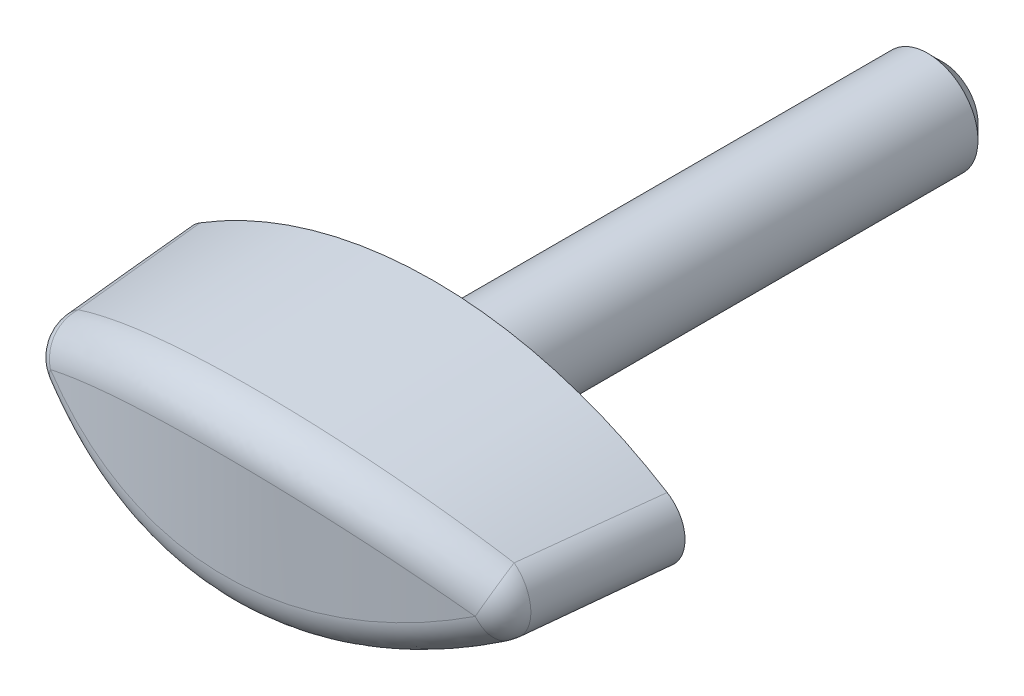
ISO-10303-21;
HEADER;
FILE_DESCRIPTION(('STEP AP214'),'2;1');
FILE_NAME('part.step','',(''),(''),'','','');
FILE_SCHEMA(('AUTOMOTIVE_DESIGN { 1 0 10303 214 1 1 1 1 }'));
ENDSEC;
DATA;
#1=APPLICATION_CONTEXT('core data for automotive mechanical design processes');
#2=APPLICATION_PROTOCOL_DEFINITION('international standard','automotive_design',2000,#1);
#3=PRODUCT_CONTEXT('',#1,'mechanical');
#4=PRODUCT('Part','Part','',(#3));
#5=PRODUCT_RELATED_PRODUCT_CATEGORY('part','',(#4));
#6=PRODUCT_DEFINITION_FORMATION('','',#4);
#7=PRODUCT_DEFINITION_CONTEXT('part definition',#1,'design');
#8=PRODUCT_DEFINITION('design','',#6,#7);
#9=PRODUCT_DEFINITION_SHAPE('','',#8);
#10=(LENGTH_UNIT() NAMED_UNIT(*) SI_UNIT(.MILLI.,.METRE.));
#11=(NAMED_UNIT(*) PLANE_ANGLE_UNIT() SI_UNIT($,.RADIAN.));
#12=(NAMED_UNIT(*) SI_UNIT($,.STERADIAN.) SOLID_ANGLE_UNIT());
#13=UNCERTAINTY_MEASURE_WITH_UNIT(LENGTH_MEASURE(1.E-05),#10,'distance_accuracy_value','');
#14=(GEOMETRIC_REPRESENTATION_CONTEXT(3) GLOBAL_UNCERTAINTY_ASSIGNED_CONTEXT((#13)) GLOBAL_UNIT_ASSIGNED_CONTEXT((#10,
#11,#12)) REPRESENTATION_CONTEXT('',''));
#15=CARTESIAN_POINT('',(0.,0.,0.));
#16=DIRECTION('',(0.,0.,1.));
#17=DIRECTION('',(1.,0.,0.));
#18=AXIS2_PLACEMENT_3D('',#15,#16,#17);
#19=CARTESIAN_POINT('',(-0.133482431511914,-27.3688144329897,0.4));
#20=DIRECTION('',(0.,0.,-1.));
#21=DIRECTION('',(1.,0.,0.));
#22=AXIS2_PLACEMENT_3D('',#19,#20,#21);
#23=CONICAL_SURFACE('',#22,35.2188144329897,0.05235987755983);
#24=CARTESIAN_POINT('',(-0.133482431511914,-27.3688144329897,0.4));
#25=DIRECTION('',(0.,0.,1.));
#26=DIRECTION('',(1.,0.,0.));
#27=AXIS2_PLACEMENT_3D('',#24,#25,#26);
#28=CIRCLE('',#27,35.2188144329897);
#29=CARTESIAN_POINT('',(18.455587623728,2.54458331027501,0.4));
#30=VERTEX_POINT('',#29);
#31=CARTESIAN_POINT('',(-18.7225524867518,2.54458331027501,0.4));
#32=VERTEX_POINT('',#31);
#33=EDGE_CURVE('E235',#30,#32,#28,.T.);
#34=ORIENTED_EDGE('',*,*,#33,.T.);
#35=CARTESIAN_POINT('',(-9.94764058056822,2.84937929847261,66.1700536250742));
#36=CARTESIAN_POINT('',(-11.9799614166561,2.17032947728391,66.5148628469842));
#37=CARTESIAN_POINT('',(-11.9799614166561,0.,66.5148628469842));
#38=CARTESIAN_POINT('',(-11.9799614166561,-2.1703294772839,66.5148628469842));
#39=CARTESIAN_POINT('',(-9.94764058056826,-2.84937929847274,66.1700536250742));
#40=CARTESIAN_POINT('',(-10.0634314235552,2.84614228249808,65.5462752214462));
#41=CARTESIAN_POINT('',(-12.0865456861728,2.1624595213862,65.8866121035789));
#42=CARTESIAN_POINT('',(-12.0866767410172,0.,65.8858334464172));
#43=CARTESIAN_POINT('',(-12.0865456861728,-2.16245952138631,65.8866121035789));
#44=CARTESIAN_POINT('',(-10.0634314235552,-2.84614228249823,65.5462752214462));
#45=CARTESIAN_POINT('',(-10.1773690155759,2.84291485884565,64.9222194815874));
#46=CARTESIAN_POINT('',(-12.1915627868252,2.15475428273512,65.2575420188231));
#47=CARTESIAN_POINT('',(-12.1916856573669,0.,65.2567934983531));
#48=CARTESIAN_POINT('',(-12.1915627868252,-2.15475428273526,65.2575420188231));
#49=CARTESIAN_POINT('',(-10.1773690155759,-2.84291485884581,64.9222194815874));
#50=CARTESIAN_POINT('',(-10.4018549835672,2.83647934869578,63.6736155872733));
#51=CARTESIAN_POINT('',(-12.3984693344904,2.13966577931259,63.9994335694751));
#52=CARTESIAN_POINT('',(-12.3985927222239,0.,63.9986847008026));
#53=CARTESIAN_POINT('',(-12.3984693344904,-2.13966577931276,63.9994335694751));
#54=CARTESIAN_POINT('',(-10.4018549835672,-2.83647934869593,63.6736155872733));
#55=CARTESIAN_POINT('',(-10.5124033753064,2.83327126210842,63.0490674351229));
#56=CARTESIAN_POINT('',(-12.5003766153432,2.13228099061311,63.3703319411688));
#57=CARTESIAN_POINT('',(-12.5004908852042,0.,63.3696158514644));
#58=CARTESIAN_POINT('',(-12.5003766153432,-2.13228099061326,63.3703319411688));
#59=CARTESIAN_POINT('',(-10.5124033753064,-2.83327126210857,63.0490674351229));
#60=CARTESIAN_POINT('',(-10.8394372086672,2.82367633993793,61.1747980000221));
#61=CARTESIAN_POINT('',(-12.8015122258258,2.1105902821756,61.4852332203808));
#62=CARTESIAN_POINT('',(-12.8019691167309,0.,61.4823746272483));
#63=CARTESIAN_POINT('',(-12.8015122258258,-2.11059028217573,61.4852332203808));
#64=CARTESIAN_POINT('',(-10.8394372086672,-2.82367633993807,61.1747980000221));
#65=CARTESIAN_POINT('',(-11.0513166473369,2.81731869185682,59.9244228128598));
#66=CARTESIAN_POINT('',(-12.9969375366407,2.09669040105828,60.2267788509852));
#67=CARTESIAN_POINT('',(-12.9973378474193,0.,60.2241384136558));
#68=CARTESIAN_POINT('',(-12.9969375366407,-2.09669040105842,60.2267788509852));
#69=CARTESIAN_POINT('',(-11.0513166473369,-2.81731869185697,59.9244228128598));
#70=CARTESIAN_POINT('',(-11.4647261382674,2.8046821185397,57.4223869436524));
#71=CARTESIAN_POINT('',(-13.3782702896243,2.06988168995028,57.7101943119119));
#72=CARTESIAN_POINT('',(-13.3786682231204,0.,57.7075667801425));
#73=CARTESIAN_POINT('',(-13.3782702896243,-2.06988168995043,57.7101943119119));
#74=CARTESIAN_POINT('',(-11.4647261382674,-2.80468211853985,57.4223869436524));
#75=CARTESIAN_POINT('',(-11.6662569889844,2.79840318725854,56.1707263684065));
#76=CARTESIAN_POINT('',(-13.5642765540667,2.05696454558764,56.4516773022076));
#77=CARTESIAN_POINT('',(-13.5646305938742,0.,56.4492313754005));
#78=CARTESIAN_POINT('',(-13.5642765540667,-2.0569645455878,56.4516773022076));
#79=CARTESIAN_POINT('',(-11.6662569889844,-2.79840318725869,56.1707263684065));
#80=CARTESIAN_POINT('',(-12.0604561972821,2.78592331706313,53.6662651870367));
#81=CARTESIAN_POINT('',(-13.9281862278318,2.03197951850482,53.9347762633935));
#82=CARTESIAN_POINT('',(-13.9285373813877,0.,53.9323448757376));
#83=CARTESIAN_POINT('',(-13.9281862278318,-2.03197951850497,53.9347762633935));
#84=CARTESIAN_POINT('',(-12.0604561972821,-2.78592331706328,53.6662651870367));
#85=CARTESIAN_POINT('',(-12.2531244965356,2.77972237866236,52.4134645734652));
#86=CARTESIAN_POINT('',(-14.1061688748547,2.01990506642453,52.6760596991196));
#87=CARTESIAN_POINT('',(-14.1064817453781,0.,52.6737937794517));
#88=CARTESIAN_POINT('',(-14.1061688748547,-2.01990506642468,52.6760596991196));
#89=CARTESIAN_POINT('',(-12.2531244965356,-2.77972237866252,52.4134645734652));
#90=CARTESIAN_POINT('',(-12.8195712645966,2.76123825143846,48.6541414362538));
#91=CARTESIAN_POINT('',(-14.6286414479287,1.98485174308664,48.9073744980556));
#92=CARTESIAN_POINT('',(-14.6299004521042,0.,48.8983113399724));
#93=CARTESIAN_POINT('',(-14.6286414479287,-1.98485174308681,48.9073744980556));
#94=CARTESIAN_POINT('',(-12.8195712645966,-2.76123825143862,48.6541414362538));
#95=CARTESIAN_POINT('',(-13.1818709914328,2.74907129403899,46.1462109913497));
#96=CARTESIAN_POINT('',(-14.963998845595,1.96287987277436,46.389071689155));
#97=CARTESIAN_POINT('',(-14.9650336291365,0.,46.3810615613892));
#98=CARTESIAN_POINT('',(-14.963998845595,-1.96287987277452,46.389071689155));
#99=CARTESIAN_POINT('',(-13.1818709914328,-2.74907129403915,46.1462109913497));
#100=CARTESIAN_POINT('',(-13.8826914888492,2.72504071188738,41.1276098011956));
#101=CARTESIAN_POINT('',(-15.6129960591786,1.92123528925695,41.353678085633));
#102=CARTESIAN_POINT('',(-15.6140160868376,0.,41.3457454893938));
#103=CARTESIAN_POINT('',(-15.6129960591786,-1.9212352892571,41.353678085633));
#104=CARTESIAN_POINT('',(-13.8826914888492,-2.72504071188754,41.1276098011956));
#105=CARTESIAN_POINT('',(-14.2212117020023,2.71317709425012,38.6169389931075));
#106=CARTESIAN_POINT('',(-15.9270018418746,1.9015334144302,38.8347968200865));
#107=CARTESIAN_POINT('',(-15.9278648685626,0.,38.8276791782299));
#108=CARTESIAN_POINT('',(-15.9270018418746,-1.90153341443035,38.8347968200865));
#109=CARTESIAN_POINT('',(-14.2212117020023,-2.71317709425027,38.6169389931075));
#110=CARTESIAN_POINT('',(-14.8789448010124,2.68974887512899,33.5943492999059));
#111=CARTESIAN_POINT('',(-16.5375019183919,1.86398835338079,33.7987360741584));
#112=CARTESIAN_POINT('',(-16.5383589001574,0.,33.7916652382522));
#113=CARTESIAN_POINT('',(-16.5375019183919,-1.86398835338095,33.7987360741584));
#114=CARTESIAN_POINT('',(-14.8789448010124,-2.68974887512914,33.5943492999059));
#115=CARTESIAN_POINT('',(-15.198163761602,2.67818418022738,31.0824310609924));
#116=CARTESIAN_POINT('',(-16.8342730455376,1.84612351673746,31.2801176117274));
#117=CARTESIAN_POINT('',(-16.8350095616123,0.,31.2737178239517));
#118=CARTESIAN_POINT('',(-16.8342730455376,-1.84612351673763,31.2801176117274));
#119=CARTESIAN_POINT('',(-15.198163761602,-2.67818418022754,31.0824310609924));
#120=CARTESIAN_POINT('',(-15.8207459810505,2.6553411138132,26.0570201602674));
#121=CARTESIAN_POINT('',(-17.4135109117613,1.81192131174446,26.2436110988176));
#122=CARTESIAN_POINT('',(-17.4142419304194,0.,26.2372505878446));
#123=CARTESIAN_POINT('',(-17.4135109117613,-1.81192131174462,26.2436110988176));
#124=CARTESIAN_POINT('',(-15.8207459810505,-2.65534111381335,26.0570201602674));
#125=CARTESIAN_POINT('',(-16.1241093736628,2.64406273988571,23.5435275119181));
#126=CARTESIAN_POINT('',(-17.6961864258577,1.79556816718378,23.7245322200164));
#127=CARTESIAN_POINT('',(-17.6968237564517,0.,23.7187307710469));
#128=CARTESIAN_POINT('',(-17.6961864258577,-1.79556816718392,23.7245322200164));
#129=CARTESIAN_POINT('',(-16.1241093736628,-2.64406273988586,23.5435275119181));
#130=CARTESIAN_POINT('',(-16.7174960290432,2.62178242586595,18.5151154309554));
#131=CARTESIAN_POINT('',(-18.2495558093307,1.76414591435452,18.6868014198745));
#132=CARTESIAN_POINT('',(-18.2501901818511,0.,18.6810256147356));
#133=CARTESIAN_POINT('',(-18.2495558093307,-1.76414591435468,18.6868014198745));
#134=CARTESIAN_POINT('',(-16.7174960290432,-2.62178242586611,18.5151154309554));
#135=CARTESIAN_POINT('',(-17.0075185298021,2.61078050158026,16.0001959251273));
#136=CARTESIAN_POINT('',(-18.5204137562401,1.74906476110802,16.1671467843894));
#137=CARTESIAN_POINT('',(-18.5209741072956,0.,16.161840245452));
#138=CARTESIAN_POINT('',(-18.5204137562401,-1.74906476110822,16.1671467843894));
#139=CARTESIAN_POINT('',(-17.007518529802,-2.61078050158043,16.0001959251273));
#140=CARTESIAN_POINT('',(-17.5761162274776,2.58904463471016,10.969297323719));
#141=CARTESIAN_POINT('',(-19.0518906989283,1.72000174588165,11.1282747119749));
#142=CARTESIAN_POINT('',(-19.0524458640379,0.,11.1230051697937));
#143=CARTESIAN_POINT('',(-19.0518906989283,-1.72000174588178,11.1282747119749));
#144=CARTESIAN_POINT('',(-17.5761162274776,-2.58904463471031,10.969297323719));
#145=CARTESIAN_POINT('',(-17.8546913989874,2.57831069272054,8.45331822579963));
#146=CARTESIAN_POINT('',(-19.3126426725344,1.70601035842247,8.60820031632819));
#147=CARTESIAN_POINT('',(-19.3131336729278,0.,8.60335546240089));
#148=CARTESIAN_POINT('',(-19.3126426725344,-1.7060103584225,8.60820031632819));
#149=CARTESIAN_POINT('',(-17.8546913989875,-2.57831069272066,8.45331822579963));
#150=CARTESIAN_POINT('',(-18.6754152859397,2.54650453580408,0.905774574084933));
#151=CARTESIAN_POINT('',(-20.0800124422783,1.66554621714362,1.06490118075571));
#152=CARTESIAN_POINT('',(-20.0819891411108,0.,1.0455066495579));
#153=CARTESIAN_POINT('',(-20.0800124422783,-1.66554621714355,1.06490118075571));
#154=CARTESIAN_POINT('',(-18.6754152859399,-2.54650453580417,0.905774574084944));
#155=CARTESIAN_POINT('',(-19.2027619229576,2.52582042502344,-4.12710669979));
#156=CARTESIAN_POINT('',(-20.5755333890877,1.64037213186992,-3.97658913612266));
#157=CARTESIAN_POINT('',(-20.5771350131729,0.,-3.9933054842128));
#158=CARTESIAN_POINT('',(-20.5755333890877,-1.64037213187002,-3.97658913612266));
#159=CARTESIAN_POINT('',(-19.2027619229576,-2.52582042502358,-4.12710669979));
#160=CARTESIAN_POINT('',(-20.2268944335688,2.4854191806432,-14.1952793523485));
#161=CARTESIAN_POINT('',(-21.5390704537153,1.59297490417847,-14.0555607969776));
#162=CARTESIAN_POINT('',(-21.5406472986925,-1.16511262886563E-13,-14.0720924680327));
#163=CARTESIAN_POINT('',(-21.5390704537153,-1.5929749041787,-14.0555607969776));
#164=CARTESIAN_POINT('',(-20.2268944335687,-2.48541918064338,-14.1952793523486));
#165=CARTESIAN_POINT('',(-20.7236810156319,2.46570202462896,-19.230570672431));
#166=CARTESIAN_POINT('',(-22.0076989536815,1.57071112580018,-19.0975815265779));
#167=CARTESIAN_POINT('',(-22.0090143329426,0.,-19.1120672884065));
#168=CARTESIAN_POINT('',(-22.0076989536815,-1.57071112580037,-19.0975815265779));
#169=CARTESIAN_POINT('',(-20.7236810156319,-2.46570202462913,-19.230570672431));
#170=CARTESIAN_POINT('',(-21.6928739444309,2.42716450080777,-29.3045674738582));
#171=CARTESIAN_POINT('',(-22.9231486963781,1.52853719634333,-29.1801362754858));
#172=CARTESIAN_POINT('',(-22.9244569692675,0.,-29.1945468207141));
#173=CARTESIAN_POINT('',(-22.9231486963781,-1.52853719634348,-29.1801362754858));
#174=CARTESIAN_POINT('',(-21.6928739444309,-2.42716450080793,-29.3045674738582));
#175=CARTESIAN_POINT('',(-22.1652730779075,2.40834439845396,-34.3432735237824));
#176=CARTESIAN_POINT('',(-23.3704165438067,1.50859917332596,-34.2242978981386));
#177=CARTESIAN_POINT('',(-23.3715262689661,0.,-34.2370518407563));
#178=CARTESIAN_POINT('',(-23.3704165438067,-1.50859917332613,-34.2242978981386));
#179=CARTESIAN_POINT('',(-22.1652730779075,-2.40834439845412,-34.3432735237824));
#180=CARTESIAN_POINT('',(-22.858760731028,2.38074702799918,-41.902509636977));
#181=CARTESIAN_POINT('',(-24.0286834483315,1.4801068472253,-41.7983357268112));
#182=CARTESIAN_POINT('',(-24.0289576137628,0.,-41.801497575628));
#183=CARTESIAN_POINT('',(-24.0286834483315,-1.48010684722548,-41.7983357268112));
#184=CARTESIAN_POINT('',(-22.858760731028,-2.38074702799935,-41.902509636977));
#185=CARTESIAN_POINT('',(-23.0874066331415,2.37165329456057,-44.42247237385));
#186=CARTESIAN_POINT('',(-24.2456523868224,1.47085913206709,-44.3201209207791));
#187=CARTESIAN_POINT('',(-24.2459077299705,0.,-44.3231153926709));
#188=CARTESIAN_POINT('',(-24.2456523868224,-1.47085913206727,-44.3201209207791));
#189=CARTESIAN_POINT('',(-23.0874066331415,-2.37165329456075,-44.42247237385));
#190=CARTESIAN_POINT('',(-23.5400779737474,2.35366995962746,-49.462737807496));
#191=CARTESIAN_POINT('',(-24.6755293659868,1.45280372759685,-49.3635662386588));
#192=CARTESIAN_POINT('',(-24.6757834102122,0.,-49.3665480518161));
#193=CARTESIAN_POINT('',(-24.6755293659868,-1.45280372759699,-49.3635662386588));
#194=CARTESIAN_POINT('',(-23.5400779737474,-2.35366995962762,-49.462737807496));
#195=CARTESIAN_POINT('',(-23.7641034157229,2.34478035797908,-51.9830405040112));
#196=CARTESIAN_POINT('',(-24.8884756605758,1.4439937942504,-51.8855627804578));
#197=CARTESIAN_POINT('',(-24.8887089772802,0.,-51.8883628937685));
#198=CARTESIAN_POINT('',(-24.8884756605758,-1.44399379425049,-51.8855627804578));
#199=CARTESIAN_POINT('',(-23.7641034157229,-2.34478035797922,-51.9830405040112));
#200=CARTESIAN_POINT('',(-23.9860278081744,2.33598938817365,-54.5034959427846));
#201=CARTESIAN_POINT('',(-25.0998062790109,1.43537470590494,-54.4102690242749));
#202=CARTESIAN_POINT('',(-25.0998062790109,0.,-54.4102690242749));
#203=CARTESIAN_POINT('',(-25.0998062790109,-1.43537470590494,-54.4102690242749));
#204=CARTESIAN_POINT('',(-23.9860278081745,-2.33598938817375,-54.5034959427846));
#205=(BOUNDED_SURFACE() B_SPLINE_SURFACE(3,2,((#35,#36,#37,#38,#39),(#40,#41,#42,#43,#44),(#45,
#46,#47,#48,#49),(#50,#51,#52,#53,#54),(#55,#56,#57,#58,#59),(#60,#61,#62,#63,#64),(#65,#66,#67,
#68,#69),(#70,#71,#72,#73,#74),(#75,#76,#77,#78,#79),(#80,#81,#82,#83,#84),(#85,#86,#87,#88,
#89),(#90,#91,#92,#93,#94),(#95,#96,#97,#98,#99),(#100,#101,#102,#103,#104),(#105,#106,#107,
#108,#109),(#110,#111,#112,#113,#114),(#115,#116,#117,#118,#119),(#120,#121,#122,#123,#124),
(#125,#126,#127,#128,#129),(#130,#131,#132,#133,#134),(#135,#136,#137,#138,#139),(#140,#141,
#142,#143,#144),(#145,#146,#147,#148,#149),(#150,#151,#152,#153,#154),(#155,#156,#157,#158,
#159),(#160,#161,#162,#163,#164),(#165,#166,#167,#168,#169),(#170,#171,#172,#173,#174),(#175,
#176,#177,#178,#179),(#180,#181,#182,#183,#184),(#185,#186,#187,#188,#189),(#190,#191,#192,#193,
#194),(#195,#196,#197,#198,#199),(#200,#201,#202,#203,#204)),.UNSPECIFIED.,.F.,.F.,
.F.) B_SPLINE_SURFACE_WITH_KNOTS((4,2,2,2,2,2,2,2,2,2,2,2,2,2,2,2,4),(3,2,3),(0.,
1.89806852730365,3.79612822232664,7.59215961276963,11.3878976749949,15.1836607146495,
22.7737107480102,30.3639386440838,37.9517650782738,45.5395274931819,53.1277227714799,
60.715934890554,75.8871979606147,91.0581091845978,106.233482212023,113.821296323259,
121.409104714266),(0.,0.5,1.),
.UNSPECIFIED.) GEOMETRIC_REPRESENTATION_ITEM() RATIONAL_B_SPLINE_SURFACE(((1.,0.810209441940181,
1.,0.810209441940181,1.),(1.,0.811220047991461,1.,0.811220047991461,1.),(1.,0.812208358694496,
1.,0.812208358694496,1.),(1.,0.814144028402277,1.,0.814144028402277,1.),(1.,0.815091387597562,
1.,0.815091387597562,1.),(1.,0.817877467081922,1.,0.817877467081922,1.),(1.,0.819660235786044,
1.,0.819660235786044,1.),(1.,0.823099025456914,1.,0.823099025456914,1.),(1.,0.824755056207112,
1.,0.824755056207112,1.),(1.,0.827957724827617,1.,0.827957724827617,1.),(1.,0.829504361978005,
1.,0.829504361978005,1.),(1.,0.834000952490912,1.,0.834000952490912,1.),(1.,0.836808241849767,
1.,0.836808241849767,1.),(1.,0.842123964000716,1.,0.842123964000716,1.),(1.,0.844632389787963,
1.,0.844632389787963,1.),(1.,0.849405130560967,1.,0.849405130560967,1.),(1.,0.85166952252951,1.,
0.85166952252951,1.),(1.,0.855995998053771,1.,0.855995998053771,1.),(1.,0.858058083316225,1.,
0.858058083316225,1.),(1.,0.86201098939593,1.,0.86201098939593,1.),(1.,0.86390180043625,1.,
0.86390180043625,1.),(1.,0.867535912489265,1.,0.867535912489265,1.),(1.,0.869279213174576,1.,
0.869279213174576,1.),(1.,0.874316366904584,1.,0.874316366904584,1.),(1.,0.877418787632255,1.,
0.877418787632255,1.),(1.,0.8832267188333,1.,0.8832267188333,1.),(1.,0.885932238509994,1.,
0.885932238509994,1.),(1.,0.89102494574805,1.,0.89102494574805,1.),(1.,0.893412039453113,1.,
0.893412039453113,1.),(1.,0.896796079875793,1.,0.896796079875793,1.),(1.,0.897891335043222,1.,
0.897891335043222,1.),(1.,0.900021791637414,1.,0.900021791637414,1.),(1.,0.901056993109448,1.,
0.901056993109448,1.),(1.,0.902064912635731,1.,0.902064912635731,1.))) REPRESENTATION_ITEM('') SURFACE());
#206=CARTESIAN_POINT('',(-23.9860278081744,2.33598938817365,-54.5034959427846));
#207=CARTESIAN_POINT('',(-23.7641034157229,2.34478035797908,-51.9830405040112));
#208=CARTESIAN_POINT('',(-23.5400779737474,2.35366995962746,-49.462737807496));
#209=CARTESIAN_POINT('',(-23.0874066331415,2.37165329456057,-44.42247237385));
#210=CARTESIAN_POINT('',(-22.858760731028,2.38074702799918,-41.902509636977));
#211=CARTESIAN_POINT('',(-22.1652730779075,2.40834439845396,-34.3432735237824));
#212=CARTESIAN_POINT('',(-21.6928739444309,2.42716450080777,-29.3045674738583));
#213=CARTESIAN_POINT('',(-20.7236810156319,2.46570202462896,-19.230570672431));
#214=CARTESIAN_POINT('',(-20.2268944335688,2.4854191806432,-14.1952793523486));
#215=CARTESIAN_POINT('',(-19.2027619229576,2.52582042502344,-4.12710669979));
#216=CARTESIAN_POINT('',(-18.6754152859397,2.54650453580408,0.90577457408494));
#217=CARTESIAN_POINT('',(-17.8546913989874,2.57831069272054,8.45331822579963));
#218=CARTESIAN_POINT('',(-17.5761162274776,2.58904463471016,10.969297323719));
#219=CARTESIAN_POINT('',(-17.0075185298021,2.61078050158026,16.0001959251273));
#220=CARTESIAN_POINT('',(-16.7174960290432,2.62178242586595,18.5151154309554));
#221=CARTESIAN_POINT('',(-16.1241093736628,2.64406273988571,23.5435275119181));
#222=CARTESIAN_POINT('',(-15.8207459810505,2.6553411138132,26.0570201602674));
#223=CARTESIAN_POINT('',(-15.198163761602,2.67818418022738,31.0824310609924));
#224=CARTESIAN_POINT('',(-14.8789448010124,2.68974887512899,33.5943492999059));
#225=CARTESIAN_POINT('',(-14.2212117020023,2.71317709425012,38.6169389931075));
#226=CARTESIAN_POINT('',(-13.8826914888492,2.72504071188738,41.1276098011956));
#227=CARTESIAN_POINT('',(-13.1818709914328,2.74907129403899,46.1462109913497));
#228=CARTESIAN_POINT('',(-12.8195712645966,2.76123825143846,48.6541414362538));
#229=CARTESIAN_POINT('',(-12.2531244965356,2.77972237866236,52.4134645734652));
#230=CARTESIAN_POINT('',(-12.0604561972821,2.78592331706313,53.6662651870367));
#231=CARTESIAN_POINT('',(-11.6662569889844,2.79840318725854,56.1707263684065));
#232=CARTESIAN_POINT('',(-11.4647261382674,2.8046821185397,57.4223869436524));
#233=CARTESIAN_POINT('',(-11.0513166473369,2.81731869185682,59.9244228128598));
#234=CARTESIAN_POINT('',(-10.8394372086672,2.82367633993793,61.1747980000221));
#235=CARTESIAN_POINT('',(-10.5124033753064,2.83327126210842,63.0490674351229));
#236=CARTESIAN_POINT('',(-10.4018549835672,2.83647934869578,63.6736155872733));
#237=CARTESIAN_POINT('',(-10.1773690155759,2.84291485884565,64.9222194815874));
#238=CARTESIAN_POINT('',(-10.0634314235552,2.84614228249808,65.5462752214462));
#239=CARTESIAN_POINT('',(-9.94764058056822,2.84937929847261,66.1700536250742));
#240=B_SPLINE_CURVE_WITH_KNOTS('',3,(#206,#207,#208,#209,#210,#211,#212,#213,#214,#215,#216,
#217,#218,#219,#220,#221,#222,#223,#224,#225,#226,#227,#228,#229,#230,#231,#232,#233,#234,#235,
#236,#237,#238,#239),.UNSPECIFIED.,.F.,.F.,(4,2,2,2,2,2,2,2,2,2,2,2,2,2,2,2,4),(0.,
7.58780839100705,15.1756225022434,30.3509955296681,45.5219067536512,60.6931698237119,
68.281381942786,75.869577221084,83.4573396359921,91.0451660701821,98.6353939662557,
106.225443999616,110.021207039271,113.816945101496,117.612976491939,119.511036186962,
121.409104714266),.UNSPECIFIED.);
#241=CARTESIAN_POINT('',(-17.5390517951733,2.5904405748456,11.2843807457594));
#242=VERTEX_POINT('',#241);
#243=EDGE_CURVE('E185',#32,#242,#240,.T.);
#244=ORIENTED_EDGE('',*,*,#243,.T.);
#245=CARTESIAN_POINT('',(-25.9116063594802,-6.5678676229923,9.45201347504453));
#246=CARTESIAN_POINT('',(-26.9623977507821,-5.22396085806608,8.77235175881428));
#247=CARTESIAN_POINT('',(-26.5522012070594,-4.61264985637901,7.09002431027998));
#248=CARTESIAN_POINT('',(-25.5819169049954,-6.22525334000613,9.66526230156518));
#249=CARTESIAN_POINT('',(-26.6372434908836,-4.84810499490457,8.99498365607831));
#250=CARTESIAN_POINT('',(-26.2149522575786,-4.23718862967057,7.28986126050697));
#251=CARTESIAN_POINT('',(-25.2442057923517,-5.8891721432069,9.8779192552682));
#252=CARTESIAN_POINT('',(-26.3045832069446,-4.4797963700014,9.21680138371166));
#253=CARTESIAN_POINT('',(-25.8694494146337,-3.86884377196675,7.48914356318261));
#254=CARTESIAN_POINT('',(-24.5528591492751,-5.23032017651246,10.3008712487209));
#255=CARTESIAN_POINT('',(-25.6221477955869,-3.75580524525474,9.65919199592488));
#256=CARTESIAN_POINT('',(-25.1620506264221,-3.14666241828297,7.88549480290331));
#257=CARTESIAN_POINT('',(-24.1992229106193,-4.90754999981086,10.5111661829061));
#258=CARTESIAN_POINT('',(-25.2722052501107,-3.40016897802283,9.87978368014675));
#259=CARTESIAN_POINT('',(-24.800153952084,-2.79282656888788,8.08256364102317));
#260=CARTESIAN_POINT('',(-23.1139686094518,-3.95902178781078,11.13710505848));
#261=CARTESIAN_POINT('',(-24.1918677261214,-2.3481514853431,10.5407319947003));
#262=CARTESIAN_POINT('',(-23.6893939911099,-1.75289230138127,8.6691352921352));
#263=CARTESIAN_POINT('',(-22.3586268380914,-3.35369283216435,11.5473966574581));
#264=CARTESIAN_POINT('',(-23.4385749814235,-1.67552627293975,10.9749701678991));
#265=CARTESIAN_POINT('',(-22.9160968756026,-1.08907596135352,9.05362238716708));
#266=CARTESIAN_POINT('',(-20.7818551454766,-2.19765537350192,12.346700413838));
#267=CARTESIAN_POINT('',(-21.8579618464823,-0.382152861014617,11.82673286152));
#268=CARTESIAN_POINT('',(-21.3014107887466,0.178913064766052,9.80265546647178));
#269=CARTESIAN_POINT('',(-19.9600203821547,-1.64733547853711,12.7355535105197));
#270=CARTESIAN_POINT('',(-21.029239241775,0.237229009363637,12.2437476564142));
#271=CARTESIAN_POINT('',(-20.4596044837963,0.782661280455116,10.1670523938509));
#272=CARTESIAN_POINT('',(-18.2575571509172,-0.610848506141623,13.4796245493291));
#273=CARTESIAN_POINT('',(-19.302109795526,1.41287325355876,13.0479460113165));
#274=CARTESIAN_POINT('',(-18.715340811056,1.91998638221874,10.8643265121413));
#275=CARTESIAN_POINT('',(-17.3769597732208,-0.124647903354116,13.834860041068));
#276=CARTESIAN_POINT('',(-18.4031396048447,1.96785628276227,13.4344551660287));
#277=CARTESIAN_POINT('',(-17.8129155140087,2.45359993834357,11.1972201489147));
#278=CARTESIAN_POINT('',(-15.7351261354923,0.691442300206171,14.4386374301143));
#279=CARTESIAN_POINT('',(-16.7179486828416,2.90601325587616,14.0960791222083));
#280=CARTESIAN_POINT('',(-16.1300201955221,3.34941894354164,11.7630241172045));
#281=CARTESIAN_POINT('',(-14.9834257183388,1.03342158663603,14.6945703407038));
#282=CARTESIAN_POINT('',(-15.9413192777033,3.3018014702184,14.3784810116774));
#283=CARTESIAN_POINT('',(-15.3593923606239,3.72486502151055,12.002860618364));
#284=CARTESIAN_POINT('',(-13.4470034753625,1.66864621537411,15.1740241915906));
#285=CARTESIAN_POINT('',(-14.3447208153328,4.04212002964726,14.9112368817));
#286=CARTESIAN_POINT('',(-13.7840433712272,4.42233580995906,12.4521601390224));
#287=CARTESIAN_POINT('',(-12.6622879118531,1.96190074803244,15.3975512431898));
#288=CARTESIAN_POINT('',(-13.5251739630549,4.38565861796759,15.1609311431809));
#289=CARTESIAN_POINT('',(-12.9793286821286,4.74437059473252,12.6616288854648));
#290=CARTESIAN_POINT('',(-11.0663718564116,2.49543766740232,15.8071244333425));
#291=CARTESIAN_POINT('',(-11.8487521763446,5.0150093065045,15.6216067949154));
#292=CARTESIAN_POINT('',(-11.3425277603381,5.33032755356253,13.0454427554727));
#293=CARTESIAN_POINT('',(-10.255274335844,2.73590291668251,15.993299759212));
#294=CARTESIAN_POINT('',(-10.9928496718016,5.29998469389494,15.8319990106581));
#295=CARTESIAN_POINT('',(-10.5105478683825,5.59445033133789,13.2199089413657));
#296=CARTESIAN_POINT('',(-8.6088043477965,3.16197518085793,16.3252089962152));
#297=CARTESIAN_POINT('',(-9.24591509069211,5.80822566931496,16.2094862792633));
#298=CARTESIAN_POINT('',(-8.82151313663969,6.06247820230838,13.5309433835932));
#299=CARTESIAN_POINT('',(-7.77343736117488,3.34759447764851,16.4709519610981));
#300=CARTESIAN_POINT('',(-8.35623326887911,6.03049926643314,16.375865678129));
#301=CARTESIAN_POINT('',(-7.96446395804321,6.26639677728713,13.6675201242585));
#302=CARTESIAN_POINT('',(-6.30456128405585,3.62036059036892,16.6864405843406));
#303=CARTESIAN_POINT('',(-6.78569450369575,6.35873278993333,16.6229913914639));
#304=CARTESIAN_POINT('',(-6.45734742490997,6.56607248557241,13.8694560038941));
#305=CARTESIAN_POINT('',(-5.67521841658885,3.7205637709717,16.7660933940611));
#306=CARTESIAN_POINT('',(-6.11075264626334,6.47970396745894,16.7146060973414));
#307=CARTESIAN_POINT('',(-5.81158450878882,6.67616820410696,13.9440992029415));
#308=CARTESIAN_POINT('',(-4.40886396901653,3.88868776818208,16.9005531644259));
#309=CARTESIAN_POINT('',(-4.74888712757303,6.68337557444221,16.8697106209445));
#310=CARTESIAN_POINT('',(-4.51213654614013,6.86089822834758,14.0701023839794));
#311=CARTESIAN_POINT('',(-3.77185121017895,3.95660355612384,16.9553562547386));
#312=CARTESIAN_POINT('',(-4.06281663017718,6.76579746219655,16.9329921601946));
#313=CARTESIAN_POINT('',(-3.85845028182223,6.93552701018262,14.1214587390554));
#314=CARTESIAN_POINT('',(-2.49262969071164,4.0595240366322,17.0393945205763));
#315=CARTESIAN_POINT('',(-2.6822628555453,6.89108237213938,17.0301954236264));
#316=CARTESIAN_POINT('',(-2.54571236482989,7.04862641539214,14.2002115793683));
#317=CARTESIAN_POINT('',(-1.85041735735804,4.09450374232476,17.0686102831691));
#318=CARTESIAN_POINT('',(-1.98872288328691,6.93373781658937,17.063960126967));
#319=CARTESIAN_POINT('',(-1.88665702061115,7.08706958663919,14.2275898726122));
#320=CARTESIAN_POINT('',(-0.564408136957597,4.13112920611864,17.1010243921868));
#321=CARTESIAN_POINT('',(-0.598226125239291,6.97862079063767,17.1013373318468));
#322=CARTESIAN_POINT('',(-0.566907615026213,7.12733004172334,14.2579653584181));
#323=CARTESIAN_POINT('',(0.0793884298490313,4.13278122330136,17.1042276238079));
#324=CARTESIAN_POINT('',(0.0977321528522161,6.98078942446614,17.1049030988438));
#325=CARTESIAN_POINT('',(0.0937861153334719,7.12915420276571,14.2609671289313));
#326=CARTESIAN_POINT('',(1.57701571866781,4.09777629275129,17.0813510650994));
#327=CARTESIAN_POINT('',(1.71713036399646,6.93858223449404,17.0779434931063));
#328=CARTESIAN_POINT('',(1.63071048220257,7.09071283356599,14.2395293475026));
#329=CARTESIAN_POINT('',(2.43040750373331,4.048363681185,17.0453117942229));
#330=CARTESIAN_POINT('',(2.63838773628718,6.87879894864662,17.035916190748));
#331=CARTESIAN_POINT('',(2.50648743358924,7.03643179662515,14.2057566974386));
#332=CARTESIAN_POINT('',(4.12803164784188,3.89140741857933,16.9281394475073));
#333=CARTESIAN_POINT('',(4.46966477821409,6.68874417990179,16.8996130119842));
#334=CARTESIAN_POINT('',(4.24857850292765,6.86400449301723,14.0959536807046));
#335=CARTESIAN_POINT('',(4.97226212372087,3.78385203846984,16.846997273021));
#336=CARTESIAN_POINT('',(5.37748567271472,6.5589210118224,16.8056638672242));
#337=CARTESIAN_POINT('',(5.11489067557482,6.74584534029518,14.0199147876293));
#338=CARTESIAN_POINT('',(6.64527404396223,3.51223605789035,16.6415410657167));
#339=CARTESIAN_POINT('',(7.17264885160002,6.23160893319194,16.5683895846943));
#340=CARTESIAN_POINT('',(6.83155366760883,6.44746416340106,13.8273803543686));
#341=CARTESIAN_POINT('',(7.47404940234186,3.34815367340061,16.5172103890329));
#342=CARTESIAN_POINT('',(8.05810540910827,6.03483393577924,16.4255836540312));
#343=CARTESIAN_POINT('',(7.68189820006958,6.26721821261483,13.7108692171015));
#344=CARTESIAN_POINT('',(9.10997409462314,2.96588856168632,16.228232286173));
#345=CARTESIAN_POINT('',(9.80010659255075,5.57782829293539,16.0948656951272));
#346=CARTESIAN_POINT('',(9.36024997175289,5.84732885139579,13.440065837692));
#347=CARTESIAN_POINT('',(9.91712421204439,2.74770779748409,16.0635863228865));
#348=CARTESIAN_POINT('',(10.6551942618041,5.31851951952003,15.9076146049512));
#349=CARTESIAN_POINT('',(10.1882580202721,5.60768759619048,13.2857749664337));
#350=CARTESIAN_POINT('',(11.5001483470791,2.26158364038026,15.698605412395));
#351=CARTESIAN_POINT('',(12.325250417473,4.74312513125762,15.4943867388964));
#352=CARTESIAN_POINT('',(11.8120079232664,5.07380137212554,12.9437488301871));
#353=CARTESIAN_POINT('',(12.2761816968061,1.99394845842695,15.498491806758));
#354=CARTESIAN_POINT('',(13.1393982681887,4.42838600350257,15.2693460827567));
#355=CARTESIAN_POINT('',(12.6079143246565,4.77989460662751,12.7562209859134));
#356=CARTESIAN_POINT('',(13.7982069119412,1.41110283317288,15.0658337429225));
#357=CARTESIAN_POINT('',(14.7286390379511,3.74621355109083,14.785275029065));
#358=CARTESIAN_POINT('',(14.1687093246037,4.13991192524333,12.3507741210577));
#359=CARTESIAN_POINT('',(14.5441984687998,1.09589190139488,14.8332889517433));
#360=CARTESIAN_POINT('',(15.5031761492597,3.37973795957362,14.5268890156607));
#361=CARTESIAN_POINT('',(14.9335976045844,3.79383547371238,12.1328547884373));
#362=CARTESIAN_POINT('',(16.0041198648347,0.420489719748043,14.3396389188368));
#363=CARTESIAN_POINT('',(17.011391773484,2.59848218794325,13.9813573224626));
#364=CARTESIAN_POINT('',(16.4302731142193,3.05239823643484,11.6702519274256));
#365=CARTESIAN_POINT('',(16.7180038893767,0.0602368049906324,14.0784945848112));
#366=CARTESIAN_POINT('',(17.744838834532,2.1845075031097,13.6947250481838));
#367=CARTESIAN_POINT('',(17.1620130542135,2.65696988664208,11.4255317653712));
#368=CARTESIAN_POINT('',(18.1103887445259,-0.702021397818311,13.5322812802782));
#369=CARTESIAN_POINT('',(19.1681779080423,1.31310015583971,13.0985006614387));
#370=CARTESIAN_POINT('',(18.5889836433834,1.82040931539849,10.9136714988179));
#371=CARTESIAN_POINT('',(18.7888850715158,-1.10403198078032,13.2472092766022));
#372=CARTESIAN_POINT('',(19.858181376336,0.856413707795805,12.7893404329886));
#373=CARTESIAN_POINT('',(19.2842096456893,1.37927129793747,10.6465285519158));
#374=CARTESIAN_POINT('',(20.180050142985,-1.99270985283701,12.6257896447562));
#375=CARTESIAN_POINT('',(21.2651061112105,-0.147392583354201,12.1194752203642));
#376=CARTESIAN_POINT('',(20.7094147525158,0.40425646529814,10.0641919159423));
#377=CARTESIAN_POINT('',(20.8884918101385,-2.48383094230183,12.2872296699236));
#378=CARTESIAN_POINT('',(21.9783423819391,-0.698893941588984,11.7567128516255));
#379=CARTESIAN_POINT('',(21.4350342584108,-0.134490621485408,9.74692502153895));
#380=CARTESIAN_POINT('',(22.2581097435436,-3.51104785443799,11.5924805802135));
#381=CARTESIAN_POINT('',(23.3501431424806,-1.84635337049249,11.0165060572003));
#382=CARTESIAN_POINT('',(22.8375560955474,-1.26110529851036,9.09587084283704));
#383=CARTESIAN_POINT('',(22.9192773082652,-4.04715191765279,11.2362882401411));
#384=CARTESIAN_POINT('',(24.0094060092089,-2.44172722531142,10.6392571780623));
#385=CARTESIAN_POINT('',(23.5144494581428,-1.84898188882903,8.76208053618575));
#386=CARTESIAN_POINT('',(24.1901225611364,-5.15942046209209,10.5143171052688));
#387=CARTESIAN_POINT('',(25.2705873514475,-3.67100849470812,9.87861765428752));
#388=CARTESIAN_POINT('',(24.8152229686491,-3.06842039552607,8.08551639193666));
#389=CARTESIAN_POINT('',(24.8000152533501,-5.73539707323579,10.14858773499));
#390=CARTESIAN_POINT('',(25.8735557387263,-4.30432956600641,9.49528806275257));
#391=CARTESIAN_POINT('',(25.4393245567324,-3.69977737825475,7.74278887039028));
#392=CARTESIAN_POINT('',(25.6774596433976,-6.62935820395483,9.59687294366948));
#393=CARTESIAN_POINT('',(26.7399086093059,-5.28595217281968,8.91806966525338));
#394=CARTESIAN_POINT('',(26.3369990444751,-4.67949322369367,7.22577312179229));
#395=CARTESIAN_POINT('',(25.9636668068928,-6.93229487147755,9.41247698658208));
#396=CARTESIAN_POINT('',(27.0211487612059,-5.61684324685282,8.72617592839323));
#397=CARTESIAN_POINT('',(26.6297680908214,-5.01145740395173,7.05297439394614));
#398=CARTESIAN_POINT('',(26.5235329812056,-7.54808714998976,9.04349060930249));
#399=CARTESIAN_POINT('',(27.5702389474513,-6.28804341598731,8.34306309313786));
#400=CARTESIAN_POINT('',(27.2024007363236,-5.68618709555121,6.7071947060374));
#401=CARTESIAN_POINT('',(26.7971919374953,-7.86094280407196,8.85890018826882));
#402=CARTESIAN_POINT('',(27.8382072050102,-6.62834466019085,8.15181272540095));
#403=CARTESIAN_POINT('',(27.482264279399,-6.02895265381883,6.53421374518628));
#404=CARTESIAN_POINT('',(27.0645147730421,-8.17870433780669,8.67464549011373));
#405=CARTESIAN_POINT('',(28.1002567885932,-6.97430695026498,7.96076026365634));
#406=CARTESIAN_POINT('',(27.7556144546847,-6.37705778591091,6.36154739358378));
#407=(BOUNDED_SURFACE() B_SPLINE_SURFACE(3,2,((#245,#246,#247),(#248,#249,#250),(#251,#252,
#253),(#254,#255,#256),(#257,#258,#259),(#260,#261,#262),(#263,#264,#265),(#266,#267,#268),
(#269,#270,#271),(#272,#273,#274),(#275,#276,#277),(#278,#279,#280),(#281,#282,#283),(#284,#285,
#286),(#287,#288,#289),(#290,#291,#292),(#293,#294,#295),(#296,#297,#298),(#299,#300,#301),
(#302,#303,#304),(#305,#306,#307),(#308,#309,#310),(#311,#312,#313),(#314,#315,#316),(#317,#318,
#319),(#320,#321,#322),(#323,#324,#325),(#326,#327,#328),(#329,#330,#331),(#332,#333,#334),
(#335,#336,#337),(#338,#339,#340),(#341,#342,#343),(#344,#345,#346),(#347,#348,#349),(#350,#351,
#352),(#353,#354,#355),(#356,#357,#358),(#359,#360,#361),(#362,#363,#364),(#365,#366,#367),
(#368,#369,#370),(#371,#372,#373),(#374,#375,#376),(#377,#378,#379),(#380,#381,#382),(#383,#384,
#385),(#386,#387,#388),(#389,#390,#391),(#392,#393,#394),(#395,#396,#397),(#398,#399,#400),
(#401,#402,#403),(#404,#405,#406)),.UNSPECIFIED.,.F.,.F.,.F.) B_SPLINE_SURFACE_WITH_KNOTS((4,2,
2,2,2,2,2,2,2,2,2,2,2,2,2,2,2,2,2,2,2,2,2,2,2,2,4),(3,3),(0.,1.50808420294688,3.01623553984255,
6.03538065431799,9.07453624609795,12.1120964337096,14.5665723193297,17.0205847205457,
19.4659573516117,21.9107819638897,23.7180809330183,25.5256612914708,27.334611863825,
29.1432227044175,31.5456360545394,33.9485342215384,36.3523594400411,38.7560974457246,
41.1453313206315,43.5345897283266,45.9271557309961,48.320025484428,50.9714043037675,
53.6232699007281,56.2633947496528,57.5830442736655,58.9026995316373),(0.,1.),
.UNSPECIFIED.) GEOMETRIC_REPRESENTATION_ITEM() RATIONAL_B_SPLINE_SURFACE(((1.,0.852899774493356,
1.),(1.,0.849934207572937,1.),(1.,0.846933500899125,1.),(1.,0.840878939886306,1.),(1.,
0.837825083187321,1.),(1.,0.82860410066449,1.),(1.,0.822383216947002,1.),(1.,0.809927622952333,
1.),(1.,0.803693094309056,1.),(1.,0.791454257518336,1.),(1.,0.785449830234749,1.),(1.,
0.775008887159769,1.),(1.,0.770492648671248,1.),(1.,0.761892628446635,1.),(1.,0.757808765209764,
1.),(1.,0.750222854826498,1.),(1.,0.746718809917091,1.),(1.,0.740406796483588,1.),(1.,
0.737598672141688,1.),(1.,0.733419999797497,1.),(1.,0.731865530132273,1.),(1.,0.7292361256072,
1.),(1.,0.728161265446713,1.),(1.,0.726518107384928,1.),(1.,0.725950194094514,1.),(1.,
0.725336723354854,1.),(1.,0.72529106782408,1.),(1.,0.725794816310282,1.),(1.,0.726544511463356,
1.),(1.,0.728935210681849,1.),(1.,0.730576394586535,1.),(1.,0.734678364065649,1.),(1.,
0.737139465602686,1.),(1.,0.742779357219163,1.),(1.,0.745958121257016,1.),(1.,0.752892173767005,
1.),(1.,0.756643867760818,1.),(1.,0.764611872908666,1.),(1.,0.768828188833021,1.),(1.,
0.777606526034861,1.),(1.,0.782169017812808,1.),(1.,0.791516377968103,1.),(1.,0.796301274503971,
1.),(1.,0.80650787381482,1.),(1.,0.811942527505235,1.),(1.,0.822820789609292,1.),(1.,
0.828264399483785,1.),(1.,0.839022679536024,1.),(1.,0.844337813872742,1.),(1.,0.852156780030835,
1.),(1.,0.854737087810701,1.),(1.,0.859836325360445,1.),(1.,0.862355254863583,1.),(1.,
0.864838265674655,1.))) REPRESENTATION_ITEM('') SURFACE());
#408=CARTESIAN_POINT('',(-26.5522012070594,-4.61264985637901,7.09002431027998));
#409=CARTESIAN_POINT('',(-26.2149522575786,-4.23718862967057,7.28986126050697));
#410=CARTESIAN_POINT('',(-25.8694494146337,-3.86884377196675,7.48914356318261));
#411=CARTESIAN_POINT('',(-25.1620506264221,-3.14666241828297,7.88549480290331));
#412=CARTESIAN_POINT('',(-24.800153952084,-2.79282656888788,8.08256364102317));
#413=CARTESIAN_POINT('',(-23.6893939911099,-1.75289230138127,8.6691352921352));
#414=CARTESIAN_POINT('',(-22.9160968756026,-1.08907596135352,9.05362238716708));
#415=CARTESIAN_POINT('',(-21.3014107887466,0.178913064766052,9.80265546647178));
#416=CARTESIAN_POINT('',(-20.4596044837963,0.782661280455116,10.1670523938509));
#417=CARTESIAN_POINT('',(-18.715340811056,1.91998638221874,10.8643265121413));
#418=CARTESIAN_POINT('',(-17.8129155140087,2.45359993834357,11.1972201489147));
#419=CARTESIAN_POINT('',(-16.1300201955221,3.34941894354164,11.7630241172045));
#420=CARTESIAN_POINT('',(-15.3593923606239,3.72486502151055,12.002860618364));
#421=CARTESIAN_POINT('',(-13.7840433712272,4.42233580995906,12.4521601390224));
#422=CARTESIAN_POINT('',(-12.9793286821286,4.74437059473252,12.6616288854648));
#423=CARTESIAN_POINT('',(-11.3425277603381,5.33032755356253,13.0454427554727));
#424=CARTESIAN_POINT('',(-10.5105478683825,5.59445033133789,13.2199089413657));
#425=CARTESIAN_POINT('',(-8.82151313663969,6.06247820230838,13.5309433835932));
#426=CARTESIAN_POINT('',(-7.96446395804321,6.26639677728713,13.6675201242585));
#427=CARTESIAN_POINT('',(-6.45734742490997,6.56607248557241,13.8694560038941));
#428=CARTESIAN_POINT('',(-5.81158450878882,6.67616820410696,13.9440992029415));
#429=CARTESIAN_POINT('',(-4.51213654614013,6.86089822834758,14.0701023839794));
#430=CARTESIAN_POINT('',(-3.85845028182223,6.93552701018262,14.1214587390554));
#431=CARTESIAN_POINT('',(-2.54571236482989,7.04862641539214,14.2002115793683));
#432=CARTESIAN_POINT('',(-1.88665702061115,7.08706958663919,14.2275898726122));
#433=CARTESIAN_POINT('',(-0.566907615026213,7.12733004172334,14.2579653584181));
#434=CARTESIAN_POINT('',(0.0937861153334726,7.12915420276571,14.2609671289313));
#435=CARTESIAN_POINT('',(1.63071048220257,7.09071283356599,14.2395293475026));
#436=CARTESIAN_POINT('',(2.50648743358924,7.03643179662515,14.2057566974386));
#437=CARTESIAN_POINT('',(4.24857850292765,6.86400449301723,14.0959536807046));
#438=CARTESIAN_POINT('',(5.11489067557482,6.74584534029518,14.0199147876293));
#439=CARTESIAN_POINT('',(6.83155366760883,6.44746416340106,13.8273803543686));
#440=CARTESIAN_POINT('',(7.68189820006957,6.26721821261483,13.7108692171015));
#441=CARTESIAN_POINT('',(9.36024997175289,5.84732885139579,13.440065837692));
#442=CARTESIAN_POINT('',(10.1882580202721,5.60768759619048,13.2857749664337));
#443=CARTESIAN_POINT('',(11.8120079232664,5.07380137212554,12.9437488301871));
#444=CARTESIAN_POINT('',(12.6079143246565,4.77989460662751,12.7562209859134));
#445=CARTESIAN_POINT('',(14.1687093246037,4.13991192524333,12.3507741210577));
#446=CARTESIAN_POINT('',(14.9335976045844,3.79383547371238,12.1328547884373));
#447=CARTESIAN_POINT('',(16.4302731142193,3.05239823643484,11.6702519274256));
#448=CARTESIAN_POINT('',(17.1620130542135,2.65696988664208,11.4255317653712));
#449=CARTESIAN_POINT('',(18.5889836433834,1.82040931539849,10.9136714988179));
#450=CARTESIAN_POINT('',(19.2842096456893,1.37927129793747,10.6465285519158));
#451=CARTESIAN_POINT('',(20.7094147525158,0.404256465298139,10.0641919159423));
#452=CARTESIAN_POINT('',(21.4350342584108,-0.134490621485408,9.74692502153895));
#453=CARTESIAN_POINT('',(22.8375560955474,-1.26110529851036,9.09587084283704));
#454=CARTESIAN_POINT('',(23.5144494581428,-1.84898188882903,8.76208053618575));
#455=CARTESIAN_POINT('',(24.8152229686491,-3.06842039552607,8.08551639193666));
#456=CARTESIAN_POINT('',(25.4393245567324,-3.69977737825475,7.74278887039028));
#457=CARTESIAN_POINT('',(26.3369990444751,-4.67949322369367,7.22577312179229));
#458=CARTESIAN_POINT('',(26.6297680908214,-5.01145740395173,7.05297439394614));
#459=CARTESIAN_POINT('',(27.2024007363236,-5.68618709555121,6.7071947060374));
#460=CARTESIAN_POINT('',(27.482264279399,-6.02895265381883,6.53421374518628));
#461=CARTESIAN_POINT('',(27.7556144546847,-6.37705778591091,6.36154739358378));
#462=B_SPLINE_CURVE_WITH_KNOTS('',3,(#408,#409,#410,#411,#412,#413,#414,#415,#416,#417,#418,
#419,#420,#421,#422,#423,#424,#425,#426,#427,#428,#429,#430,#431,#432,#433,#434,#435,#436,#437,
#438,#439,#440,#441,#442,#443,#444,#445,#446,#447,#448,#449,#450,#451,#452,#453,#454,#455,#456,
#457,#458,#459,#460,#461),.UNSPECIFIED.,.F.,.F.,(4,2,2,2,2,2,2,2,2,2,2,2,2,2,2,2,2,2,2,2,2,2,2,
2,2,2,4),(0.,1.50808420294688,3.01623553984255,6.03538065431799,9.07453624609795,
12.1120964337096,14.5665723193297,17.0205847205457,19.4659573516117,21.9107819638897,
23.7180809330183,25.5256612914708,27.334611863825,29.1432227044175,31.5456360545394,
33.9485342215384,36.3523594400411,38.7560974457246,41.1453313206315,43.5345897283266,
45.9271557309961,48.320025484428,50.9714043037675,53.6232699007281,56.2633947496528,
57.5830442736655,58.9026995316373),.UNSPECIFIED.);
#463=CARTESIAN_POINT('',(17.2607608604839,2.59087539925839,11.3857437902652));
#464=VERTEX_POINT('',#463);
#465=EDGE_CURVE('E72',#242,#464,#462,.T.);
#466=ORIENTED_EDGE('',*,*,#465,.T.);
#467=CARTESIAN_POINT('',(9.66971649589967,-2.84968552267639,66.2290571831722));
#468=CARTESIAN_POINT('',(11.7028962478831,-2.17107541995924,66.5743641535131));
#469=CARTESIAN_POINT('',(11.7028962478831,0.,66.5743641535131));
#470=CARTESIAN_POINT('',(11.7028962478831,2.17107541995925,66.5743641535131));
#471=CARTESIAN_POINT('',(9.66971649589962,2.84968552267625,66.2290571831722));
#472=CARTESIAN_POINT('',(9.78561316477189,-2.84644824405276,65.6053622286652));
#473=CARTESIAN_POINT('',(11.8095777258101,-2.16319517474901,65.9461812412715));
#474=CARTESIAN_POINT('',(11.8097090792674,0.,65.9454015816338));
#475=CARTESIAN_POINT('',(11.8095777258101,2.16319517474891,65.9461812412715));
#476=CARTESIAN_POINT('',(9.78561316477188,2.84644824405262,65.6053622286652));
#477=CARTESIAN_POINT('',(9.89965101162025,-2.84322055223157,64.9813888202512));
#478=CARTESIAN_POINT('',(11.9146870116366,-2.15548013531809,65.3171781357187));
#479=CARTESIAN_POINT('',(11.9148101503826,0.,65.3164286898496));
#480=CARTESIAN_POINT('',(11.9146870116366,2.15548013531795,65.3171781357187));
#481=CARTESIAN_POINT('',(9.89965101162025,2.84322055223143,64.9813888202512));
#482=CARTESIAN_POINT('',(10.1243278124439,-2.83678449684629,63.7329477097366));
#483=CARTESIAN_POINT('',(12.1217686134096,-2.14037293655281,64.0592041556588));
#484=CARTESIAN_POINT('',(12.121892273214,0.,64.0584543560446));
#485=CARTESIAN_POINT('',(12.1217686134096,2.14037293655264,64.0592041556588));
#486=CARTESIAN_POINT('',(10.1243278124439,2.83678449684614,63.7329477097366));
#487=CARTESIAN_POINT('',(10.2349667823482,-2.83357613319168,63.1084800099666));
#488=CARTESIAN_POINT('',(12.2237588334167,-2.13297924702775,63.4301698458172));
#489=CARTESIAN_POINT('',(12.2238733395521,0.,63.4294529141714));
#490=CARTESIAN_POINT('',(12.2237588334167,2.13297924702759,63.4301698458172));
#491=CARTESIAN_POINT('',(10.2349667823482,2.83357613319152,63.1084800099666));
#492=CARTESIAN_POINT('',(10.5622600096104,-2.82398037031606,61.2344497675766));
#493=CARTESIAN_POINT('',(12.5251307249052,-2.11126305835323,61.5452763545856));
#494=CARTESIAN_POINT('',(12.5255885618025,0.,61.5424144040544));
#495=CARTESIAN_POINT('',(12.5251307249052,2.11126305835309,61.5452763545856));
#496=CARTESIAN_POINT('',(10.5622600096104,2.8239803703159,61.2344497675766));
#497=CARTESIAN_POINT('',(10.7742959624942,-2.81762214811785,59.9842309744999));
#498=CARTESIAN_POINT('',(12.720698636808,-2.09734766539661,60.2869570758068));
#499=CARTESIAN_POINT('',(12.7210996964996,0.,60.2843138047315));
#500=CARTESIAN_POINT('',(12.720698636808,2.09734766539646,60.2869570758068));
#501=CARTESIAN_POINT('',(10.7742959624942,2.8176221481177,59.9842309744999));
#502=CARTESIAN_POINT('',(11.1879936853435,-2.80498441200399,57.4825039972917));
#503=CARTESIAN_POINT('',(13.1022928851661,-2.070510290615,57.7706446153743));
#504=CARTESIAN_POINT('',(13.1026915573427,0.,57.7680142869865));
#505=CARTESIAN_POINT('',(13.1022928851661,2.07051029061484,57.7706446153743));
#506=CARTESIAN_POINT('',(11.1879936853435,2.80498441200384,57.4825039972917));
#507=CARTESIAN_POINT('',(11.389656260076,-2.79870489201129,56.23099592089));
#508=CARTESIAN_POINT('',(13.2884183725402,-2.05757996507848,56.5122637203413));
#509=CARTESIAN_POINT('',(13.2887730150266,0.,56.5098153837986));
#510=CARTESIAN_POINT('',(13.2884183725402,2.05757996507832,56.5122637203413));
#511=CARTESIAN_POINT('',(11.389656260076,2.79870489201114,56.23099592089));
#512=CARTESIAN_POINT('',(11.7840997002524,-2.78622383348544,53.7268364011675));
#513=CARTESIAN_POINT('',(13.652548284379,-2.03257041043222,53.9956357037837));
#514=CARTESIAN_POINT('',(13.6529000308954,0.,53.9932019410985));
#515=CARTESIAN_POINT('',(13.652548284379,2.03257041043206,53.9956357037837));
#516=CARTESIAN_POINT('',(11.7840997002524,2.78622383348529,53.7268364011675));
#517=CARTESIAN_POINT('',(11.976880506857,-2.7800222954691,52.4741849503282));
#518=CARTESIAN_POINT('',(13.830632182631,-2.02048459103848,52.7370553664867));
#519=CARTESIAN_POINT('',(13.830945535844,0.,52.7347874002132));
#520=CARTESIAN_POINT('',(13.830632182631,2.02048459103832,52.7370553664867));
#521=CARTESIAN_POINT('',(11.976880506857,2.78002229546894,52.4741849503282));
#522=CARTESIAN_POINT('',(12.5436417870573,-2.76153637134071,48.7153076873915));
#523=CARTESIAN_POINT('',(14.3533853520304,-1.98539948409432,48.9687880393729));
#524=CARTESIAN_POINT('',(14.3546463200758,0.,48.9597166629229));
#525=CARTESIAN_POINT('',(14.3533853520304,1.98539948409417,48.9687880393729));
#526=CARTESIAN_POINT('',(12.5436417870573,2.76153637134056,48.7153076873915));
#527=CARTESIAN_POINT('',(12.9061209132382,-2.74936820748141,46.2076702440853));
#528=CARTESIAN_POINT('',(14.6889032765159,-1.96340915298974,46.4507584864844));
#529=CARTESIAN_POINT('',(14.689939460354,0.,46.4427419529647));
#530=CARTESIAN_POINT('',(14.6889032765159,1.96340915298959,46.4507584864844));
#531=CARTESIAN_POINT('',(12.9061209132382,2.74936820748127,46.2076702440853));
#532=CARTESIAN_POINT('',(13.6072603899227,-2.72533520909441,41.1896487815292));
#533=CARTESIAN_POINT('',(15.3381838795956,-1.92173152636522,41.4159140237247));
#534=CARTESIAN_POINT('',(15.3392052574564,0.,41.4079752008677));
#535=CARTESIAN_POINT('',(15.3381838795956,1.92173152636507,41.4159140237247));
#536=CARTESIAN_POINT('',(13.6072603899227,2.72533520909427,41.1896487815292));
#537=CARTESIAN_POINT('',(13.9459201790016,-2.71347038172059,38.6792646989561));
#538=CARTESIAN_POINT('',(15.6523133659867,-1.90201499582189,38.8973058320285));
#539=CARTESIAN_POINT('',(15.6531774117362,0.,38.890183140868));
#540=CARTESIAN_POINT('',(15.6523133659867,1.90201499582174,38.8973058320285));
#541=CARTESIAN_POINT('',(13.9459201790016,2.71347038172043,38.6792646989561));
#542=CARTESIAN_POINT('',(14.6039038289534,-2.69003976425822,33.6572468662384));
#543=CARTESIAN_POINT('',(16.263034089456,-1.86444339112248,33.861795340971));
#544=CARTESIAN_POINT('',(16.2638920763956,0.,33.8547195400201));
#545=CARTESIAN_POINT('',(16.263034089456,1.86444339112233,33.861795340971));
#546=CARTESIAN_POINT('',(14.6039038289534,2.69003976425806,33.6572468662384));
#547=CARTESIAN_POINT('',(14.9232337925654,-2.67847388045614,31.1456137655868));
#548=CARTESIAN_POINT('',(16.55990272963,-1.84656661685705,31.3434521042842));
#549=CARTESIAN_POINT('',(16.5606400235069,0.,31.3370482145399));
#550=CARTESIAN_POINT('',(16.55990272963,1.84656661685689,31.3434521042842));
#551=CARTESIAN_POINT('',(14.9232337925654,2.67847388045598,31.1456137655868));
#552=CARTESIAN_POINT('',(15.5460173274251,-2.65562845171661,26.1207705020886));
#553=CARTESIAN_POINT('',(17.1393163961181,-1.81234254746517,26.3074972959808));
#554=CARTESIAN_POINT('',(17.1400481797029,0.,26.3011327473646));
#555=CARTESIAN_POINT('',(17.1393163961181,1.81234254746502,26.3074972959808));
#556=CARTESIAN_POINT('',(15.5460173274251,2.65562845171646,26.1207705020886));
#557=CARTESIAN_POINT('',(15.8494710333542,-2.64434890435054,23.6075603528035));
#558=CARTESIAN_POINT('',(17.4220705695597,-1.79597944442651,23.7886934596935));
#559=CARTESIAN_POINT('',(17.422708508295,0.,23.7828886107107));
#560=CARTESIAN_POINT('',(17.4220705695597,1.79597944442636,23.7886934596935));
#561=CARTESIAN_POINT('',(15.8494710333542,2.64434890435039,23.6075603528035));
#562=CARTESIAN_POINT('',(16.4430227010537,-2.62206625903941,18.5797106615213));
#563=CARTESIAN_POINT('',(17.9755828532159,-1.76453879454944,18.7515129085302));
#564=CARTESIAN_POINT('',(17.9762178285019,0.,18.7457337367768));
#565=CARTESIAN_POINT('',(17.9755828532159,1.76453879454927,18.7515129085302));
#566=CARTESIAN_POINT('',(16.4430227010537,2.62206625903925,18.5797106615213));
#567=CARTESIAN_POINT('',(16.7331198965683,-2.61106317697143,16.0650710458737));
#568=CARTESIAN_POINT('',(18.2465053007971,-1.74944918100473,16.2321323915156));
#569=CARTESIAN_POINT('',(18.247066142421,0.,16.2268229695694));
#570=CARTESIAN_POINT('',(18.2465053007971,1.74944918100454,16.2321323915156));
#571=CARTESIAN_POINT('',(16.7331198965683,2.61106317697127,16.0650710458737));
#572=CARTESIAN_POINT('',(17.301854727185,-2.58932501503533,11.034730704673));
#573=CARTESIAN_POINT('',(18.7780999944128,-1.72037043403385,11.1938090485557));
#574=CARTESIAN_POINT('',(18.7786556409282,0.,11.1885366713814));
#575=CARTESIAN_POINT('',(18.7780999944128,1.72037043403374,11.1938090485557));
#576=CARTESIAN_POINT('',(17.301854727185,2.58932501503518,11.034730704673));
#577=CARTESIAN_POINT('',(17.5804923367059,-2.57858993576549,8.5190299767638));
#578=CARTESIAN_POINT('',(19.038905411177,-1.70637175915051,8.67400842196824));
#579=CARTESIAN_POINT('',(19.0393968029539,0.,8.66916113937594));
#580=CARTESIAN_POINT('',(19.038905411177,1.70637175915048,8.67400842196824));
#581=CARTESIAN_POINT('',(17.5804923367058,2.57858993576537,8.51902997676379));
#582=CARTESIAN_POINT('',(18.4013883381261,-2.54678042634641,0.972325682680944));
#583=CARTESIAN_POINT('',(19.8064203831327,-1.66588728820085,1.1315445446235));
#584=CARTESIAN_POINT('',(19.8083986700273,0.,1.11214029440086));
#585=CARTESIAN_POINT('',(19.8064203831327,1.66588728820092,1.1315445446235));
#586=CARTESIAN_POINT('',(18.401388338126,2.54678042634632,0.972325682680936));
#587=CARTESIAN_POINT('',(18.9288302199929,-2.52609413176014,-4.05999629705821));
#588=CARTESIAN_POINT('',(20.302021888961,-1.64070140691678,-3.90939472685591));
#589=CARTESIAN_POINT('',(20.3036246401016,0.,-3.92611856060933));
#590=CARTESIAN_POINT('',(20.302021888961,1.64070140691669,-3.90939472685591));
#591=CARTESIAN_POINT('',(18.9288302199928,2.52609413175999,-4.05999629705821));
#592=CARTESIAN_POINT('',(19.9531275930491,-2.4856886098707,-14.1270526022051));
#593=CARTESIAN_POINT('',(21.2656963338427,-1.59328310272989,-13.9872605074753));
#594=CARTESIAN_POINT('',(21.2672742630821,-1.09250433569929E-13,-14.0037994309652));
#595=CARTESIAN_POINT('',(21.2656963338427,1.59328310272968,-13.9872605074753));
#596=CARTESIAN_POINT('',(19.9531275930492,2.48568860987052,-14.1270526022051));
#597=CARTESIAN_POINT('',(20.4499837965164,-2.46596936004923,-19.1617868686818));
#598=CARTESIAN_POINT('',(21.7343823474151,-1.57100998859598,-19.0287298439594));
#599=CARTESIAN_POINT('',(21.7356985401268,0.,-19.0432214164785));
#600=CARTESIAN_POINT('',(21.7343823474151,1.5710099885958,-19.0287298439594));
#601=CARTESIAN_POINT('',(20.4499837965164,2.46596936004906,-19.1617868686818));
#602=CARTESIAN_POINT('',(21.4192982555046,-2.42742771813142,-29.2346754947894));
#603=CARTESIAN_POINT('',(22.6499308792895,-1.52881913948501,-29.1101837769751));
#604=CARTESIAN_POINT('',(22.6512399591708,0.,-29.1246000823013));
#605=CARTESIAN_POINT('',(22.6499308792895,1.52881913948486,-29.1101837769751));
#606=CARTESIAN_POINT('',(21.4192982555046,2.42742771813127,-29.2346754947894));
#607=CARTESIAN_POINT('',(21.8917492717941,-2.4086055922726,-34.2728304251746));
#608=CARTESIAN_POINT('',(23.0972404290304,-1.50887350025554,-34.1537984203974));
#609=CARTESIAN_POINT('',(23.0983507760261,0.,-34.166557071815));
#610=CARTESIAN_POINT('',(23.0972404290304,1.50887350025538,-34.1537984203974));
#611=CARTESIAN_POINT('',(21.8917492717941,2.40860559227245,-34.2728304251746));
#612=CARTESIAN_POINT('',(22.5853047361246,-2.38100524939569,-41.831241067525));
#613=CARTESIAN_POINT('',(23.7555612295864,-1.48037069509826,-41.7270184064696));
#614=CARTESIAN_POINT('',(23.7558355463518,0.,-41.7301814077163));
#615=CARTESIAN_POINT('',(23.7555612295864,1.48037069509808,-41.7270184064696));
#616=CARTESIAN_POINT('',(22.5853047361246,2.38100524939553,-41.831241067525));
#617=CARTESIAN_POINT('',(22.8139715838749,-2.37191053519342,-44.3509289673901));
#618=CARTESIAN_POINT('',(23.9725465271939,-1.47111965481,-44.2485301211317));
#619=CARTESIAN_POINT('',(23.9728020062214,0.,-44.2515256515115));
#620=CARTESIAN_POINT('',(23.9725465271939,1.47111965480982,-44.2485301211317));
#621=CARTESIAN_POINT('',(22.8139715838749,2.37191053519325,-44.3509289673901));
#622=CARTESIAN_POINT('',(23.2666818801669,-2.35392525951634,-49.390645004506));
#623=CARTESIAN_POINT('',(24.4024536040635,-1.45305788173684,-49.2914284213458));
#624=CARTESIAN_POINT('',(24.4027077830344,0.,-49.2944112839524));
#625=CARTESIAN_POINT('',(24.4024536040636,1.4530578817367,-49.2914284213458));
#626=CARTESIAN_POINT('',(23.2666818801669,2.35392525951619,-49.390645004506));
#627=CARTESIAN_POINT('',(23.4907253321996,-2.3450346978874,-51.9106731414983));
#628=CARTESIAN_POINT('',(24.6154136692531,-1.44424490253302,-51.8131516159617));
#629=CARTESIAN_POINT('',(24.6156471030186,0.,-51.8159526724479));
#630=CARTESIAN_POINT('',(24.6154136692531,1.44424490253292,-51.8131516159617));
#631=CARTESIAN_POINT('',(23.4907253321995,2.34503469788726,-51.9106731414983));
#632=CARTESIAN_POINT('',(23.7126664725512,-2.33624277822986,-54.4308541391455));
#633=CARTESIAN_POINT('',(24.8267570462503,-1.43562288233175,-54.3375854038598));
#634=CARTESIAN_POINT('',(24.8267570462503,0.,-54.3375854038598));
#635=CARTESIAN_POINT('',(24.8267570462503,1.43562288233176,-54.3375854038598));
#636=CARTESIAN_POINT('',(23.7126664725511,2.33624277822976,-54.4308541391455));
#637=(BOUNDED_SURFACE() B_SPLINE_SURFACE(3,2,((#467,#468,#469,#470,#471),(#472,#473,#474,#475,
#476),(#477,#478,#479,#480,#481),(#482,#483,#484,#485,#486),(#487,#488,#489,#490,#491),(#492,
#493,#494,#495,#496),(#497,#498,#499,#500,#501),(#502,#503,#504,#505,#506),(#507,#508,#509,#510,
#511),(#512,#513,#514,#515,#516),(#517,#518,#519,#520,#521),(#522,#523,#524,#525,#526),(#527,
#528,#529,#530,#531),(#532,#533,#534,#535,#536),(#537,#538,#539,#540,#541),(#542,#543,#544,#545,
#546),(#547,#548,#549,#550,#551),(#552,#553,#554,#555,#556),(#557,#558,#559,#560,#561),(#562,
#563,#564,#565,#566),(#567,#568,#569,#570,#571),(#572,#573,#574,#575,#576),(#577,#578,#579,#580,
#581),(#582,#583,#584,#585,#586),(#587,#588,#589,#590,#591),(#592,#593,#594,#595,#596),(#597,
#598,#599,#600,#601),(#602,#603,#604,#605,#606),(#607,#608,#609,#610,#611),(#612,#613,#614,#615,
#616),(#617,#618,#619,#620,#621),(#622,#623,#624,#625,#626),(#627,#628,#629,#630,#631),(#632,
#633,#634,#635,#636)),.UNSPECIFIED.,.F.,.F.,.F.) B_SPLINE_SURFACE_WITH_KNOTS((4,2,2,2,2,2,2,2,2,
2,2,2,2,2,2,2,4),(3,2,3),(0.,1.8978687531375,3.7957286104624,7.59135976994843,11.3866960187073,
15.1820574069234,22.7712977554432,30.3607169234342,37.9477273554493,45.534673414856,
53.1220541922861,60.7094519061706,75.8790682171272,91.0483311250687,106.222068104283,
113.809064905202,121.39605597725),(0.,0.5,1.),
.UNSPECIFIED.) GEOMETRIC_REPRESENTATION_ITEM() RATIONAL_B_SPLINE_SURFACE(((1.,0.810113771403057,
1.,0.810113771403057,1.),(1.,0.811125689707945,1.,0.811125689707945,1.),(1.,0.81211524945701,1.,
0.81211524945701,1.),(1.,0.81405330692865,1.,0.81405330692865,1.),(1.,0.81500180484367,1.,
0.81500180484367,1.),(1.,0.81779115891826,1.,0.81779115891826,1.),(1.,0.819575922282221,1.,
0.819575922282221,1.),(1.,0.823018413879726,1.,0.823018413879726,1.),(1.,0.824676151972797,1.,
0.824676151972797,1.),(1.,0.827882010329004,1.,0.827882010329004,1.),(1.,0.829430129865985,1.,
0.829430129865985,1.),(1.,0.833930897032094,1.,0.833930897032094,1.),(1.,0.836740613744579,1.,
0.836740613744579,1.),(1.,0.842060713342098,1.,0.842060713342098,1.),(1.,0.844571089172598,1.,
0.844571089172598,1.),(1.,0.849347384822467,1.,0.849347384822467,1.),(1.,0.85161338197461,1.,
0.85161338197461,1.),(1.,0.855942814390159,1.,0.855942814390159,1.),(1.,0.858006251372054,1.,
0.858006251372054,1.),(1.,0.861961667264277,1.,0.861961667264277,1.),(1.,0.863853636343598,1.,
0.863853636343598,1.),(1.,0.867489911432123,1.,0.867489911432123,1.),(1.,0.869234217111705,1.,
0.869234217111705,1.),(1.,0.874274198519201,1.,0.874274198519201,1.),(1.,0.877378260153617,1.,
0.877378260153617,1.),(1.,0.883189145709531,1.,0.883189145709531,1.),(1.,0.8858959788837,1.,
0.8858959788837,1.),(1.,0.890991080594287,1.,0.890991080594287,1.),(1.,0.893379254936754,1.,
0.893379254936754,1.),(1.,0.896764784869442,1.,0.896764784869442,1.),(1.,0.897860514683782,1.,
0.897860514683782,1.),(1.,0.899991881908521,1.,0.899991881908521,1.),(1.,0.901027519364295,1.,
0.901027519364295,1.),(1.,0.902035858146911,1.,0.902035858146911,1.))) REPRESENTATION_ITEM('') SURFACE());
#638=CARTESIAN_POINT('',(9.66971649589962,2.84968552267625,66.2290571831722));
#639=CARTESIAN_POINT('',(9.78561316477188,2.84644824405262,65.6053622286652));
#640=CARTESIAN_POINT('',(9.89965101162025,2.84322055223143,64.9813888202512));
#641=CARTESIAN_POINT('',(10.1243278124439,2.83678449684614,63.7329477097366));
#642=CARTESIAN_POINT('',(10.2349667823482,2.83357613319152,63.1084800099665));
#643=CARTESIAN_POINT('',(10.5622600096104,2.8239803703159,61.2344497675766));
#644=CARTESIAN_POINT('',(10.7742959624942,2.8176221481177,59.9842309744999));
#645=CARTESIAN_POINT('',(11.1879936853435,2.80498441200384,57.4825039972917));
#646=CARTESIAN_POINT('',(11.389656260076,2.79870489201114,56.23099592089));
#647=CARTESIAN_POINT('',(11.7840997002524,2.78622383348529,53.7268364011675));
#648=CARTESIAN_POINT('',(11.976880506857,2.78002229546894,52.4741849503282));
#649=CARTESIAN_POINT('',(12.5436417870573,2.76153637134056,48.7153076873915));
#650=CARTESIAN_POINT('',(12.9061209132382,2.74936820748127,46.2076702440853));
#651=CARTESIAN_POINT('',(13.6072603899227,2.72533520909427,41.1896487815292));
#652=CARTESIAN_POINT('',(13.9459201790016,2.71347038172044,38.6792646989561));
#653=CARTESIAN_POINT('',(14.6039038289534,2.69003976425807,33.6572468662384));
#654=CARTESIAN_POINT('',(14.9232337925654,2.67847388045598,31.1456137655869));
#655=CARTESIAN_POINT('',(15.5460173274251,2.65562845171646,26.1207705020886));
#656=CARTESIAN_POINT('',(15.8494710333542,2.64434890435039,23.6075603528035));
#657=CARTESIAN_POINT('',(16.4430227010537,2.62206625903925,18.5797106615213));
#658=CARTESIAN_POINT('',(16.7331198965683,2.61106317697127,16.0650710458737));
#659=CARTESIAN_POINT('',(17.301854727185,2.58932501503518,11.034730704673));
#660=CARTESIAN_POINT('',(17.5804923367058,2.57858993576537,8.51902997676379));
#661=CARTESIAN_POINT('',(18.401388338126,2.54678042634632,0.972325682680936));
#662=CARTESIAN_POINT('',(18.9288302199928,2.52609413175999,-4.05999629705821));
#663=CARTESIAN_POINT('',(19.9531275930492,2.48568860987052,-14.1270526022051));
#664=CARTESIAN_POINT('',(20.4499837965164,2.46596936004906,-19.1617868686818));
#665=CARTESIAN_POINT('',(21.4192982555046,2.42742771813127,-29.2346754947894));
#666=CARTESIAN_POINT('',(21.8917492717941,2.40860559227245,-34.2728304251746));
#667=CARTESIAN_POINT('',(22.5853047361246,2.38100524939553,-41.831241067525));
#668=CARTESIAN_POINT('',(22.8139715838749,2.37191053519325,-44.3509289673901));
#669=CARTESIAN_POINT('',(23.2666818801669,2.35392525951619,-49.390645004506));
#670=CARTESIAN_POINT('',(23.4907253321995,2.34503469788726,-51.9106731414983));
#671=CARTESIAN_POINT('',(23.7126664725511,2.33624277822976,-54.4308541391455));
#672=B_SPLINE_CURVE_WITH_KNOTS('',3,(#638,#639,#640,#641,#642,#643,#644,#645,#646,#647,#648,
#649,#650,#651,#652,#653,#654,#655,#656,#657,#658,#659,#660,#661,#662,#663,#664,#665,#666,#667,
#668,#669,#670,#671),.UNSPECIFIED.,.F.,.F.,(4,2,2,2,2,2,2,2,2,2,2,2,2,2,2,2,4),(0.,
1.8978687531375,3.7957286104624,7.59135976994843,11.3866960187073,15.1820574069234,
22.7712977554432,30.3607169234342,37.9477273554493,45.534673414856,53.1220541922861,
60.7094519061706,75.8790682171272,91.0483311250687,106.222068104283,113.809064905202,
121.39605597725),.UNSPECIFIED.);
#673=EDGE_CURVE('E95',#464,#30,#672,.T.);
#674=ORIENTED_EDGE('',*,*,#673,.T.);
#675=EDGE_LOOP('',(#34,#244,#466,#674));
#676=FACE_BOUND('',#675,.T.);
#677=ADVANCED_FACE('F14',(#676),#23,.T.);
#678=CARTESIAN_POINT('',(-0.133482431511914,27.3688144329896,0.4));
#679=DIRECTION('',(0.,0.,-1.));
#680=DIRECTION('',(1.,0.,0.));
#681=AXIS2_PLACEMENT_3D('',#678,#679,#680);
#682=CONICAL_SURFACE('',#681,35.2188144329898,0.05235987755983);
#683=CARTESIAN_POINT('',(25.6578311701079,6.61269599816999,9.60792230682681));
#684=CARTESIAN_POINT('',(26.7213133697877,5.26849873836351,8.92913725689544));
#685=CARTESIAN_POINT('',(26.3169072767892,4.66122312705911,7.23612755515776));
#686=CARTESIAN_POINT('',(25.3295692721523,6.27019123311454,9.81744341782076));
#687=CARTESIAN_POINT('',(26.3974486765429,4.89277276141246,9.14811889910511));
#688=CARTESIAN_POINT('',(25.981103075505,4.28588626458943,7.43247123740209));
#689=CARTESIAN_POINT('',(24.9933127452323,5.93419120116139,10.026403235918));
#690=CARTESIAN_POINT('',(26.0660945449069,4.52456145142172,9.36632786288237));
#691=CARTESIAN_POINT('',(25.6370732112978,3.9176353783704,7.62828892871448));
#692=CARTESIAN_POINT('',(24.3049372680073,5.27544512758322,10.4420270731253));
#693=CARTESIAN_POINT('',(25.3863323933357,3.80071721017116,9.80155345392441));
#694=CARTESIAN_POINT('',(24.9326850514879,3.19558135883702,8.01777290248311));
#695=CARTESIAN_POINT('',(23.9528176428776,4.95269965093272,10.6486909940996));
#696=CARTESIAN_POINT('',(25.0377587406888,3.4451300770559,10.0185885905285));
#697=CARTESIAN_POINT('',(24.5723260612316,2.841778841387,8.21143909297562));
#698=CARTESIAN_POINT('',(22.8722359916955,4.00417427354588,11.2638286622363));
#699=CARTESIAN_POINT('',(23.9616912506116,2.39322777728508,10.6688826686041));
#700=CARTESIAN_POINT('',(23.4663067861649,1.80186817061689,8.78788885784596));
#701=CARTESIAN_POINT('',(22.1201548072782,3.39873569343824,11.6670590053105));
#702=CARTESIAN_POINT('',(23.211377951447,1.72056840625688,11.096162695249));
#703=CARTESIAN_POINT('',(22.6963216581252,1.13794761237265,9.165758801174));
#704=CARTESIAN_POINT('',(20.5503161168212,2.24225807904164,12.4525039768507));
#705=CARTESIAN_POINT('',(21.6371567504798,0.426955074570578,11.9341955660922));
#706=CARTESIAN_POINT('',(21.0886868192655,-0.130488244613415,9.90180471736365));
#707=CARTESIAN_POINT('',(19.7321610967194,1.691600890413,12.8345638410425));
#708=CARTESIAN_POINT('',(20.811868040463,-0.192647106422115,12.3444488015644));
#709=CARTESIAN_POINT('',(20.2506273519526,-0.734586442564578,10.2598356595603));
#710=CARTESIAN_POINT('',(18.0374186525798,0.65408561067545,13.5654614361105));
#711=CARTESIAN_POINT('',(19.0920246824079,-1.36904862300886,13.1354523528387));
#712=CARTESIAN_POINT('',(18.5142336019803,-1.87299658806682,10.9447648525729));
#713=CARTESIAN_POINT('',(17.160861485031,0.167194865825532,13.9143161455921));
#714=CARTESIAN_POINT('',(18.1969181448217,-1.92457880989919,13.5155394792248));
#715=CARTESIAN_POINT('',(17.6159305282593,-2.40734425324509,11.2716790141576));
#716=CARTESIAN_POINT('',(15.523936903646,-0.651907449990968,14.5079758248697));
#717=CARTESIAN_POINT('',(16.5162715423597,-2.8657029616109,14.1670282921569));
#718=CARTESIAN_POINT('',(15.9380380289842,-3.30642513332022,11.8280016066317));
#719=CARTESIAN_POINT('',(14.7729075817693,-0.995963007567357,14.7599865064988));
#720=CARTESIAN_POINT('',(15.7401377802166,-3.26364047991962,14.4455227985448));
#721=CARTESIAN_POINT('',(15.1680861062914,-3.68413008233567,12.0641625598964));
#722=CARTESIAN_POINT('',(13.2378248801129,-1.63530776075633,15.2316855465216));
#723=CARTESIAN_POINT('',(14.1445379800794,-4.00820901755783,14.9705084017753));
#724=CARTESIAN_POINT('',(13.5940883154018,-4.38608248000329,12.5061949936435));
#725=CARTESIAN_POINT('',(12.4537776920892,-1.9306060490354,15.4513799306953));
#726=CARTESIAN_POINT('',(13.3254975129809,-4.35384667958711,15.2163454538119));
#727=CARTESIAN_POINT('',(12.7900488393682,-4.71033989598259,12.7120721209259));
#728=CARTESIAN_POINT('',(10.8591827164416,-2.46822268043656,15.853389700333));
#729=CARTESIAN_POINT('',(11.6500931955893,-4.98737440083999,15.6693632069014));
#730=CARTESIAN_POINT('',(11.1545844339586,-5.30073317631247,13.0887982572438));
#731=CARTESIAN_POINT('',(10.0487368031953,-2.71072206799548,16.0358326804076));
#732=CARTESIAN_POINT('',(10.7947039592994,-5.27442440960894,15.8759605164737));
#733=CARTESIAN_POINT('',(10.3232647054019,-5.56706765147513,13.2597668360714));
#734=CARTESIAN_POINT('',(8.40359404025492,-3.14087358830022,16.3603531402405));
#735=CARTESIAN_POINT('',(9.04885405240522,-5.78681440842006,16.2458897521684));
#736=CARTESIAN_POINT('',(8.63557705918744,-6.0395306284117,13.5638772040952));
#737=CARTESIAN_POINT('',(7.5689025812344,-3.32853781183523,16.5024395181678));
#738=CARTESIAN_POINT('',(8.15974592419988,-6.01116118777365,16.4085152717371));
#739=CARTESIAN_POINT('',(7.77921470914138,-6.24567240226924,13.697027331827));
#740=CARTESIAN_POINT('',(6.09802475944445,-3.60549500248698,16.7120915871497));
#741=CARTESIAN_POINT('',(6.58681600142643,-6.34375607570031,16.6496819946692));
#742=CARTESIAN_POINT('',(6.27003520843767,-6.54991153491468,13.8934937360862));
#743=CARTESIAN_POINT('',(5.46594695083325,-3.70767429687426,16.7894243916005));
#744=CARTESIAN_POINT('',(5.90885278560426,-6.46681221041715,16.7389386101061));
#745=CARTESIAN_POINT('',(5.62146248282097,-6.6621607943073,13.9659628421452));
#746=CARTESIAN_POINT('',(4.19407327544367,-3.87944597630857,16.9190261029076));
#747=CARTESIAN_POINT('',(4.54088171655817,-6.67428724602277,16.8890594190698));
#748=CARTESIAN_POINT('',(4.31634496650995,-6.85086323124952,14.0874135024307));
#749=CARTESIAN_POINT('',(3.55427619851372,-3.94903318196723,16.9712910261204));
#750=CARTESIAN_POINT('',(3.85174023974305,-6.75842329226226,16.9497173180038));
#751=CARTESIAN_POINT('',(3.6597989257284,-6.92731071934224,14.1363913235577));
#752=CARTESIAN_POINT('',(2.26948370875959,-4.05499515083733,17.0500254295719));
#753=CARTESIAN_POINT('',(2.46504936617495,-6.8867686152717,17.0413951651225));
#754=CARTESIAN_POINT('',(2.34134004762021,-7.0437163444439,14.210173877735));
#755=CARTESIAN_POINT('',(1.6244847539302,-4.0913449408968,17.0764755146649));
#756=CARTESIAN_POINT('',(1.76845731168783,-6.93076815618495,17.0722619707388));
#757=CARTESIAN_POINT('',(1.67942355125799,-7.08364704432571,14.2349604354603));
#758=CARTESIAN_POINT('',(0.332941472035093,-4.13041726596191,17.1031333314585));
#759=CARTESIAN_POINT('',(0.371924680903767,-6.9779805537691,17.1035718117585));
#760=CARTESIAN_POINT('',(0.353993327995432,-7.12656024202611,14.2599416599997));
#761=CARTESIAN_POINT('',(-0.313602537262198,-4.13314620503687,17.1033460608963));
#762=CARTESIAN_POINT('',(-0.327003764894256,-6.98113465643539,17.103973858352));
#763=CARTESIAN_POINT('',(-0.309520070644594,-7.12954977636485,14.2601410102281));
#764=CARTESIAN_POINT('',(-1.81497458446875,-4.10038141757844,17.0733019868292));
#765=CARTESIAN_POINT('',(-1.95038353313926,-6.94089920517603,17.0694078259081));
#766=CARTESIAN_POINT('',(-1.85028596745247,-7.09352816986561,14.2319865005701));
#767=CARTESIAN_POINT('',(-2.66934099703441,-4.05220303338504,17.0331399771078));
#768=CARTESIAN_POINT('',(-2.87261629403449,-6.882192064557,17.0230128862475));
#769=CARTESIAN_POINT('',(-2.72706095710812,-7.04057955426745,14.1943504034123));
#770=CARTESIAN_POINT('',(-4.36877753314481,-3.89761893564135,16.9076315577));
#771=CARTESIAN_POINT('',(-4.70560749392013,-6.69418862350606,16.877883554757));
#772=CARTESIAN_POINT('',(-4.4710049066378,-6.87071158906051,14.0767355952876));
#773=CARTESIAN_POINT('',(-5.21384575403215,-3.79120152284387,16.8222760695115));
#774=CARTESIAN_POINT('',(-5.61416547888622,-6.5653449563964,16.7794917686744));
#775=CARTESIAN_POINT('',(-5.3381719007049,-6.75377938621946,13.9967483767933));
#776=CARTESIAN_POINT('',(-6.88839457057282,-3.52180564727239,16.6083219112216));
#777=CARTESIAN_POINT('',(-7.41057150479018,-6.23995359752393,16.5332847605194));
#778=CARTESIAN_POINT('',(-7.05639954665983,-6.45779129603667,13.7962504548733));
#779=CARTESIAN_POINT('',(-7.71786901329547,-3.35880533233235,16.4797065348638));
#780=CARTESIAN_POINT('',(-8.2965372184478,-6.04412345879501,16.386002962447));
#781=CARTESIAN_POINT('',(-7.90745384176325,-6.27871140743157,13.6757240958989));
#782=CARTESIAN_POINT('',(-9.3550618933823,-2.97868585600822,16.1821071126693));
#783=CARTESIAN_POINT('',(-10.0393518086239,-5.58902392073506,16.0463238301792));
#784=CARTESIAN_POINT('',(-9.58708906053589,-5.8611346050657,13.3968416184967));
#785=CARTESIAN_POINT('',(-10.1627811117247,-2.76156864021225,16.0131245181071));
#786=CARTESIAN_POINT('',(-10.8947509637,-5.33067859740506,15.854599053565));
#787=CARTESIAN_POINT('',(-10.4156707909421,-5.62263982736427,13.2384868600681));
#788=CARTESIAN_POINT('',(-11.7467811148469,-2.27759464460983,15.6394679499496));
#789=CARTESIAN_POINT('',(-12.5652159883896,-4.75728211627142,15.4324762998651));
#790=CARTESIAN_POINT('',(-12.0403990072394,-5.09107297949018,12.8883307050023));
#791=CARTESIAN_POINT('',(-12.5232234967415,-2.0110490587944,15.4350177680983));
#792=CARTESIAN_POINT('',(-13.3794726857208,-4.44358107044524,15.2030255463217));
#793=CARTESIAN_POINT('',(-12.8367123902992,-4.79834238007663,12.6967390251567));
#794=CARTESIAN_POINT('',(-14.0459858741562,-1.43042995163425,14.9936558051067));
#795=CARTESIAN_POINT('',(-14.9688233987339,-3.7635801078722,14.7101594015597));
#796=CARTESIAN_POINT('',(-14.3982359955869,-4.16076510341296,12.2831356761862));
#797=CARTESIAN_POINT('',(-14.7923055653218,-1.11635595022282,14.7567436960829));
#798=CARTESIAN_POINT('',(-15.7433710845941,-3.39823653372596,14.4473938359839));
#799=CARTESIAN_POINT('',(-15.1634459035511,-3.8159178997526,12.0611236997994));
#800=CARTESIAN_POINT('',(-16.2528357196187,-0.443295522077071,14.2543184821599));
#801=CARTESIAN_POINT('',(-17.2515529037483,-2.61935776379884,13.8931154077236));
#802=CARTESIAN_POINT('',(-16.6607137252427,-3.07701490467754,11.5902975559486));
#803=CARTESIAN_POINT('',(-16.9670001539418,-0.0842473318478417,13.9887661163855));
#804=CARTESIAN_POINT('',(-17.9849640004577,-2.20662546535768,13.6021188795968));
#805=CARTESIAN_POINT('',(-17.3927241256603,-2.68289144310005,11.3414465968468));
#806=CARTESIAN_POINT('',(-18.3599265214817,0.675519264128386,13.4336933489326));
#807=CARTESIAN_POINT('',(-19.4082194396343,-1.33782436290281,12.9971691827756));
#808=CARTESIAN_POINT('',(-18.820213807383,-1.84903217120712,10.8212840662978));
#809=CARTESIAN_POINT('',(-19.0386839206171,1.0762429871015,13.1441698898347));
#810=CARTESIAN_POINT('',(-20.0981822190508,-0.882498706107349,12.6836492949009));
#811=CARTESIAN_POINT('',(-19.5156884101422,-1.40929054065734,10.5499696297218));
#812=CARTESIAN_POINT('',(-20.4313690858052,1.96272012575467,12.512872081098));
#813=CARTESIAN_POINT('',(-21.5060042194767,0.118987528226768,12.0041200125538));
#814=CARTESIAN_POINT('',(-20.9424090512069,-0.436659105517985,9.95837608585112));
#815=CARTESIAN_POINT('',(-21.1410117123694,2.45297956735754,12.1688475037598));
#816=CARTESIAN_POINT('',(-22.2201349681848,0.669589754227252,11.6360106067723));
#817=CARTESIAN_POINT('',(-21.6692353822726,0.101157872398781,9.63598827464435));
#818=CARTESIAN_POINT('',(-22.5129690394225,3.47847069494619,11.4630329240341));
#819=CARTESIAN_POINT('',(-23.5936709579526,1.81521771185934,10.885017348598));
#820=CARTESIAN_POINT('',(-23.074103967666,1.2259070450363,8.97456454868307));
#821=CARTESIAN_POINT('',(-23.1752749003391,4.01371074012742,11.1012396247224));
#822=CARTESIAN_POINT('',(-24.253781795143,2.40966061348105,10.5023289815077));
#823=CARTESIAN_POINT('',(-23.7521371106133,1.81284836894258,8.63552554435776));
#824=CARTESIAN_POINT('',(-24.4483433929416,5.12422507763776,10.3679665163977));
#825=CARTESIAN_POINT('',(-25.5166233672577,3.63702813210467,9.73074485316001));
#826=CARTESIAN_POINT('',(-25.0551330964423,3.03038471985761,7.94837024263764));
#827=CARTESIAN_POINT('',(-25.059323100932,5.69930980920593,9.9965372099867));
#828=CARTESIAN_POINT('',(-26.1204111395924,4.26936544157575,9.34191020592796));
#829=CARTESIAN_POINT('',(-25.6803195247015,3.66077298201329,7.60030127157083));
#830=CARTESIAN_POINT('',(-25.9384150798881,6.59193340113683,9.43616950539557));
#831=CARTESIAN_POINT('',(-26.9880372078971,5.24950581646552,8.75631915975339));
#832=CARTESIAN_POINT('',(-26.5796370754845,4.6390336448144,7.07517681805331));
#833=CARTESIAN_POINT('',(-26.2251730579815,6.8944229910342,9.24887333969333));
#834=CARTESIAN_POINT('',(-27.2697022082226,5.57989755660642,8.56163205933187));
#835=CARTESIAN_POINT('',(-26.8729551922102,4.97051101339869,6.89966028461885));
#836=CARTESIAN_POINT('',(-26.7861527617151,7.5093250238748,8.87405151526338));
#837=CARTESIAN_POINT('',(-27.8196593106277,6.25009988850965,8.17290271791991));
#838=CARTESIAN_POINT('',(-27.446697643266,5.64427050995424,6.54841215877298));
#839=CARTESIAN_POINT('',(-27.0603744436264,7.82173750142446,8.6865258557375));
#840=CARTESIAN_POINT('',(-28.0880700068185,6.58990253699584,7.97882887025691));
#841=CARTESIAN_POINT('',(-27.72712193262,5.98655267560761,6.37268056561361));
#842=CARTESIAN_POINT('',(-27.3282687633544,8.1390596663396,8.49931830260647));
#843=CARTESIAN_POINT('',(-28.3505769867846,6.93537053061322,7.78492737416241));
#844=CARTESIAN_POINT('',(-28.001041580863,6.33417813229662,6.19724707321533));
#845=(BOUNDED_SURFACE() B_SPLINE_SURFACE(3,2,((#683,#684,#685),(#686,#687,#688),(#689,#690,
#691),(#692,#693,#694),(#695,#696,#697),(#698,#699,#700),(#701,#702,#703),(#704,#705,#706),
(#707,#708,#709),(#710,#711,#712),(#713,#714,#715),(#716,#717,#718),(#719,#720,#721),(#722,#723,
#724),(#725,#726,#727),(#728,#729,#730),(#731,#732,#733),(#734,#735,#736),(#737,#738,#739),
(#740,#741,#742),(#743,#744,#745),(#746,#747,#748),(#749,#750,#751),(#752,#753,#754),(#755,#756,
#757),(#758,#759,#760),(#761,#762,#763),(#764,#765,#766),(#767,#768,#769),(#770,#771,#772),
(#773,#774,#775),(#776,#777,#778),(#779,#780,#781),(#782,#783,#784),(#785,#786,#787),(#788,#789,
#790),(#791,#792,#793),(#794,#795,#796),(#797,#798,#799),(#800,#801,#802),(#803,#804,#805),
(#806,#807,#808),(#809,#810,#811),(#812,#813,#814),(#815,#816,#817),(#818,#819,#820),(#821,#822,
#823),(#824,#825,#826),(#827,#828,#829),(#830,#831,#832),(#833,#834,#835),(#836,#837,#838),
(#839,#840,#841),(#842,#843,#844)),.UNSPECIFIED.,.F.,.F.,.F.) B_SPLINE_SURFACE_WITH_KNOTS((4,2,
2,2,2,2,2,2,2,2,2,2,2,2,2,2,2,2,2,2,2,2,2,2,2,2,4),(3,3),(0.,1.50125554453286,3.00257501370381,
6.00797225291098,9.03303332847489,12.0565392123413,14.5087928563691,16.9605886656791,
19.4038401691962,21.8465525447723,23.6615532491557,25.4768422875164,27.2934941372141,
29.1097999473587,31.5152265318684,33.9211365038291,36.3279766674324,38.7347303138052,
41.1268163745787,43.5189265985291,45.9143587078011,48.3100968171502,50.968122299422,
53.6266428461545,56.2732849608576,57.5961808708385,58.9190813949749),(0.,1.),
.UNSPECIFIED.) GEOMETRIC_REPRESENTATION_ITEM() RATIONAL_B_SPLINE_SURFACE(((1.,0.851990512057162,
1.),(1.,0.849044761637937,1.),(1.,0.846064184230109,1.),(1.,0.84005047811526,1.),(1.,
0.837017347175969,1.),(1.,0.827859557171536,1.),(1.,0.821681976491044,1.),(1.,0.809315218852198,
1.),(1.,0.803126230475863,1.),(1.,0.790978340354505,1.),(1.,0.785019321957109,1.),(1.,
0.774641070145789,1.),(1.,0.77014363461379,1.),(1.,0.761581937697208,1.),(1.,0.757517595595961,
1.),(1.,0.749971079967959,1.),(1.,0.746486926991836,1.),(1.,0.740214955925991,1.),(1.,
0.73742698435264,1.),(1.,0.733274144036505,1.),(1.,0.731727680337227,1.),(1.,0.729119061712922,
1.),(1.,0.728056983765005,1.),(1.,0.726444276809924,1.),(1.,0.725894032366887,1.),(1.,
0.725320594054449,1.),(1.,0.725297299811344,1.),(1.,0.72585713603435,1.),(1.,0.726639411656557,
1.),(1.,0.729096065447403,1.),(1.,0.730770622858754,1.),(1.,0.734938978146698,1.),(1.,
0.737433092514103,1.),(1.,0.743137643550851,1.),(1.,0.746348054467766,1.),(1.,0.753342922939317,
1.),(1.,0.757123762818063,1.),(1.,0.765147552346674,1.),(1.,0.769390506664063,1.),(1.,
0.778219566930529,1.),(1.,0.78280614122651,1.),(1.,0.792199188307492,1.),(1.,0.797005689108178,
1.),(1.,0.807262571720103,1.),(1.,0.812725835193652,1.),(1.,0.823659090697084,1.),(1.,
0.829129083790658,1.),(1.,0.839937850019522,1.),(1.,0.845277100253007,1.),(1.,0.853131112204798,
1.),(1.,0.855722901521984,1.),(1.,0.860844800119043,1.),(1.,0.863374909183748,1.),(1.,
0.865868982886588,1.))) REPRESENTATION_ITEM('') SURFACE());
#846=CARTESIAN_POINT('',(26.3169072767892,4.66122312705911,7.23612755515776));
#847=CARTESIAN_POINT('',(25.981103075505,4.28588626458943,7.43247123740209));
#848=CARTESIAN_POINT('',(25.6370732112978,3.9176353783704,7.62828892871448));
#849=CARTESIAN_POINT('',(24.9326850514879,3.19558135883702,8.01777290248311));
#850=CARTESIAN_POINT('',(24.5723260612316,2.841778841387,8.21143909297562));
#851=CARTESIAN_POINT('',(23.4663067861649,1.80186817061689,8.78788885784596));
#852=CARTESIAN_POINT('',(22.6963216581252,1.13794761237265,9.165758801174));
#853=CARTESIAN_POINT('',(21.0886868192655,-0.130488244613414,9.90180471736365));
#854=CARTESIAN_POINT('',(20.2506273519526,-0.734586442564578,10.2598356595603));
#855=CARTESIAN_POINT('',(18.5142336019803,-1.87299658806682,10.9447648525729));
#856=CARTESIAN_POINT('',(17.6159305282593,-2.40734425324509,11.2716790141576));
#857=CARTESIAN_POINT('',(15.9380380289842,-3.30642513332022,11.8280016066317));
#858=CARTESIAN_POINT('',(15.1680861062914,-3.68413008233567,12.0641625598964));
#859=CARTESIAN_POINT('',(13.5940883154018,-4.38608248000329,12.5061949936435));
#860=CARTESIAN_POINT('',(12.7900488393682,-4.71033989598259,12.7120721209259));
#861=CARTESIAN_POINT('',(11.1545844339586,-5.30073317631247,13.0887982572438));
#862=CARTESIAN_POINT('',(10.3232647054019,-5.56706765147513,13.2597668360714));
#863=CARTESIAN_POINT('',(8.63557705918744,-6.0395306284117,13.5638772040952));
#864=CARTESIAN_POINT('',(7.77921470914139,-6.24567240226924,13.697027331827));
#865=CARTESIAN_POINT('',(6.27003520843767,-6.54991153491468,13.8934937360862));
#866=CARTESIAN_POINT('',(5.62146248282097,-6.6621607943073,13.9659628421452));
#867=CARTESIAN_POINT('',(4.31634496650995,-6.85086323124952,14.0874135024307));
#868=CARTESIAN_POINT('',(3.6597989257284,-6.92731071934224,14.1363913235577));
#869=CARTESIAN_POINT('',(2.34134004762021,-7.0437163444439,14.210173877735));
#870=CARTESIAN_POINT('',(1.67942355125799,-7.08364704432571,14.2349604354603));
#871=CARTESIAN_POINT('',(0.353993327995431,-7.12656024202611,14.2599416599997));
#872=CARTESIAN_POINT('',(-0.309520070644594,-7.12954977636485,14.2601410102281));
#873=CARTESIAN_POINT('',(-1.85028596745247,-7.09352816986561,14.2319865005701));
#874=CARTESIAN_POINT('',(-2.72706095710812,-7.04057955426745,14.1943504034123));
#875=CARTESIAN_POINT('',(-4.4710049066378,-6.87071158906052,14.0767355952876));
#876=CARTESIAN_POINT('',(-5.3381719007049,-6.75377938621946,13.9967483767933));
#877=CARTESIAN_POINT('',(-7.05639954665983,-6.45779129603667,13.7962504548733));
#878=CARTESIAN_POINT('',(-7.90745384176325,-6.27871140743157,13.6757240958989));
#879=CARTESIAN_POINT('',(-9.58708906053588,-5.8611346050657,13.3968416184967));
#880=CARTESIAN_POINT('',(-10.4156707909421,-5.62263982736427,13.2384868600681));
#881=CARTESIAN_POINT('',(-12.0403990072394,-5.09107297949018,12.8883307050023));
#882=CARTESIAN_POINT('',(-12.8367123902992,-4.79834238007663,12.6967390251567));
#883=CARTESIAN_POINT('',(-14.3982359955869,-4.16076510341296,12.2831356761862));
#884=CARTESIAN_POINT('',(-15.1634459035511,-3.8159178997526,12.0611236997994));
#885=CARTESIAN_POINT('',(-16.6607137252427,-3.07701490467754,11.5902975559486));
#886=CARTESIAN_POINT('',(-17.3927241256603,-2.68289144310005,11.3414465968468));
#887=CARTESIAN_POINT('',(-18.820213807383,-1.84903217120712,10.8212840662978));
#888=CARTESIAN_POINT('',(-19.5156884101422,-1.40929054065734,10.5499696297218));
#889=CARTESIAN_POINT('',(-20.9424090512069,-0.436659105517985,9.95837608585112));
#890=CARTESIAN_POINT('',(-21.6692353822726,0.101157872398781,9.63598827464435));
#891=CARTESIAN_POINT('',(-23.074103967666,1.2259070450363,8.97456454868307));
#892=CARTESIAN_POINT('',(-23.7521371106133,1.81284836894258,8.63552554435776));
#893=CARTESIAN_POINT('',(-25.0551330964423,3.03038471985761,7.94837024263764));
#894=CARTESIAN_POINT('',(-25.6803195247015,3.66077298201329,7.60030127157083));
#895=CARTESIAN_POINT('',(-26.5796370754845,4.6390336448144,7.07517681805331));
#896=CARTESIAN_POINT('',(-26.8729551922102,4.97051101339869,6.89966028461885));
#897=CARTESIAN_POINT('',(-27.446697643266,5.64427050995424,6.54841215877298));
#898=CARTESIAN_POINT('',(-27.72712193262,5.98655267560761,6.37268056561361));
#899=CARTESIAN_POINT('',(-28.001041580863,6.33417813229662,6.19724707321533));
#900=B_SPLINE_CURVE_WITH_KNOTS('',3,(#846,#847,#848,#849,#850,#851,#852,#853,#854,#855,#856,
#857,#858,#859,#860,#861,#862,#863,#864,#865,#866,#867,#868,#869,#870,#871,#872,#873,#874,#875,
#876,#877,#878,#879,#880,#881,#882,#883,#884,#885,#886,#887,#888,#889,#890,#891,#892,#893,#894,
#895,#896,#897,#898,#899),.UNSPECIFIED.,.F.,.F.,(4,2,2,2,2,2,2,2,2,2,2,2,2,2,2,2,2,2,2,2,2,2,2,
2,2,2,4),(0.,1.50125554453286,3.00257501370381,6.00797225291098,9.03303332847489,
12.0565392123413,14.5087928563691,16.9605886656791,19.4038401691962,21.8465525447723,
23.6615532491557,25.4768422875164,27.2934941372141,29.1097999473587,31.5152265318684,
33.9211365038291,36.3279766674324,38.7347303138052,41.1268163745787,43.5189265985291,
45.9143587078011,48.3100968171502,50.968122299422,53.6266428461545,56.2732849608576,
57.5961808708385,58.9190813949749),.UNSPECIFIED.);
#901=CARTESIAN_POINT('',(17.2607608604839,-2.59087539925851,11.3857437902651));
#902=VERTEX_POINT('',#901);
#903=CARTESIAN_POINT('',(-17.5390517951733,-2.59044057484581,11.2843807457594));
#904=VERTEX_POINT('',#903);
#905=EDGE_CURVE('E35',#902,#904,#900,.T.);
#906=ORIENTED_EDGE('',*,*,#905,.T.);
#907=CARTESIAN_POINT('',(-9.94764058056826,-2.84937929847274,66.1700536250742));
#908=CARTESIAN_POINT('',(-10.0634314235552,-2.84614228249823,65.5462752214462));
#909=CARTESIAN_POINT('',(-10.1773690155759,-2.84291485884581,64.9222194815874));
#910=CARTESIAN_POINT('',(-10.4018549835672,-2.83647934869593,63.6736155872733));
#911=CARTESIAN_POINT('',(-10.5124033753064,-2.83327126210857,63.0490674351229));
#912=CARTESIAN_POINT('',(-10.8394372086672,-2.82367633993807,61.1747980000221));
#913=CARTESIAN_POINT('',(-11.0513166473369,-2.81731869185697,59.9244228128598));
#914=CARTESIAN_POINT('',(-11.4647261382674,-2.80468211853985,57.4223869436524));
#915=CARTESIAN_POINT('',(-11.6662569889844,-2.79840318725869,56.1707263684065));
#916=CARTESIAN_POINT('',(-12.0604561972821,-2.78592331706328,53.6662651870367));
#917=CARTESIAN_POINT('',(-12.2531244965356,-2.77972237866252,52.4134645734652));
#918=CARTESIAN_POINT('',(-12.8195712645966,-2.76123825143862,48.6541414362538));
#919=CARTESIAN_POINT('',(-13.1818709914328,-2.74907129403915,46.1462109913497));
#920=CARTESIAN_POINT('',(-13.8826914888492,-2.72504071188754,41.1276098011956));
#921=CARTESIAN_POINT('',(-14.2212117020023,-2.71317709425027,38.6169389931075));
#922=CARTESIAN_POINT('',(-14.8789448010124,-2.68974887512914,33.5943492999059));
#923=CARTESIAN_POINT('',(-15.198163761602,-2.67818418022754,31.0824310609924));
#924=CARTESIAN_POINT('',(-15.8207459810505,-2.65534111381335,26.0570201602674));
#925=CARTESIAN_POINT('',(-16.1241093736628,-2.64406273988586,23.5435275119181));
#926=CARTESIAN_POINT('',(-16.7174960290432,-2.62178242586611,18.5151154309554));
#927=CARTESIAN_POINT('',(-17.007518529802,-2.61078050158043,16.0001959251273));
#928=CARTESIAN_POINT('',(-17.5761162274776,-2.58904463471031,10.969297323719));
#929=CARTESIAN_POINT('',(-17.8546913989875,-2.57831069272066,8.45331822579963));
#930=CARTESIAN_POINT('',(-18.6754152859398,-2.54650453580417,0.905774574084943));
#931=CARTESIAN_POINT('',(-19.2027619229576,-2.52582042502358,-4.12710669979));
#932=CARTESIAN_POINT('',(-20.2268944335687,-2.48541918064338,-14.1952793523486));
#933=CARTESIAN_POINT('',(-20.7236810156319,-2.46570202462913,-19.230570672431));
#934=CARTESIAN_POINT('',(-21.6928739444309,-2.42716450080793,-29.3045674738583));
#935=CARTESIAN_POINT('',(-22.1652730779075,-2.40834439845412,-34.3432735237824));
#936=CARTESIAN_POINT('',(-22.858760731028,-2.38074702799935,-41.902509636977));
#937=CARTESIAN_POINT('',(-23.0874066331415,-2.37165329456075,-44.42247237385));
#938=CARTESIAN_POINT('',(-23.5400779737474,-2.35366995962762,-49.462737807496));
#939=CARTESIAN_POINT('',(-23.7641034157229,-2.34478035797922,-51.9830405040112));
#940=CARTESIAN_POINT('',(-23.9860278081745,-2.33598938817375,-54.5034959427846));
#941=B_SPLINE_CURVE_WITH_KNOTS('',3,(#907,#908,#909,#910,#911,#912,#913,#914,#915,#916,#917,
#918,#919,#920,#921,#922,#923,#924,#925,#926,#927,#928,#929,#930,#931,#932,#933,#934,#935,#936,
#937,#938,#939,#940),.UNSPECIFIED.,.F.,.F.,(4,2,2,2,2,2,2,2,2,2,2,2,2,2,2,2,4),(0.,
1.89806852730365,3.79612822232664,7.59215961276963,11.3878976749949,15.1836607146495,
22.7737107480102,30.3639386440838,37.9517650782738,45.5395274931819,53.1277227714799,
60.715934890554,75.8871979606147,91.0581091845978,106.233482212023,113.821296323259,
121.409104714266),.UNSPECIFIED.);
#942=CARTESIAN_POINT('',(-18.7225524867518,-2.54458331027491,0.4));
#943=VERTEX_POINT('',#942);
#944=EDGE_CURVE('E220',#904,#943,#941,.T.);
#945=ORIENTED_EDGE('',*,*,#944,.T.);
#946=CARTESIAN_POINT('',(-0.133482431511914,27.3688144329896,0.4));
#947=DIRECTION('',(0.,0.,1.));
#948=DIRECTION('',(1.,0.,0.));
#949=AXIS2_PLACEMENT_3D('',#946,#947,#948);
#950=CIRCLE('',#949,35.2188144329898);
#951=CARTESIAN_POINT('',(18.455587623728,-2.54458331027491,0.4));
#952=VERTEX_POINT('',#951);
#953=EDGE_CURVE('E92',#943,#952,#950,.T.);
#954=ORIENTED_EDGE('',*,*,#953,.T.);
#955=CARTESIAN_POINT('',(23.7126664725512,-2.33624277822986,-54.4308541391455));
#956=CARTESIAN_POINT('',(23.4907253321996,-2.3450346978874,-51.9106731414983));
#957=CARTESIAN_POINT('',(23.2666818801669,-2.35392525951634,-49.390645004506));
#958=CARTESIAN_POINT('',(22.8139715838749,-2.37191053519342,-44.3509289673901));
#959=CARTESIAN_POINT('',(22.5853047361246,-2.38100524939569,-41.831241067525));
#960=CARTESIAN_POINT('',(21.8917492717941,-2.4086055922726,-34.2728304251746));
#961=CARTESIAN_POINT('',(21.4192982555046,-2.42742771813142,-29.2346754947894));
#962=CARTESIAN_POINT('',(20.4499837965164,-2.46596936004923,-19.1617868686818));
#963=CARTESIAN_POINT('',(19.9531275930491,-2.4856886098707,-14.1270526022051));
#964=CARTESIAN_POINT('',(18.9288302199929,-2.52609413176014,-4.05999629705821));
#965=CARTESIAN_POINT('',(18.4013883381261,-2.54678042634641,0.97232568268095));
#966=CARTESIAN_POINT('',(17.5804923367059,-2.57858993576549,8.51902997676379));
#967=CARTESIAN_POINT('',(17.301854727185,-2.58932501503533,11.034730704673));
#968=CARTESIAN_POINT('',(16.7331198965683,-2.61106317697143,16.0650710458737));
#969=CARTESIAN_POINT('',(16.4430227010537,-2.62206625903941,18.5797106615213));
#970=CARTESIAN_POINT('',(15.8494710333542,-2.64434890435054,23.6075603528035));
#971=CARTESIAN_POINT('',(15.5460173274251,-2.65562845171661,26.1207705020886));
#972=CARTESIAN_POINT('',(14.9232337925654,-2.67847388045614,31.1456137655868));
#973=CARTESIAN_POINT('',(14.6039038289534,-2.69003976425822,33.6572468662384));
#974=CARTESIAN_POINT('',(13.9459201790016,-2.71347038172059,38.6792646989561));
#975=CARTESIAN_POINT('',(13.6072603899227,-2.72533520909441,41.1896487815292));
#976=CARTESIAN_POINT('',(12.9061209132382,-2.74936820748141,46.2076702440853));
#977=CARTESIAN_POINT('',(12.5436417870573,-2.76153637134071,48.7153076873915));
#978=CARTESIAN_POINT('',(11.976880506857,-2.7800222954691,52.4741849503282));
#979=CARTESIAN_POINT('',(11.7840997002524,-2.78622383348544,53.7268364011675));
#980=CARTESIAN_POINT('',(11.389656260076,-2.79870489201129,56.23099592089));
#981=CARTESIAN_POINT('',(11.1879936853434,-2.80498441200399,57.4825039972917));
#982=CARTESIAN_POINT('',(10.7742959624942,-2.81762214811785,59.9842309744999));
#983=CARTESIAN_POINT('',(10.5622600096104,-2.82398037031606,61.2344497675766));
#984=CARTESIAN_POINT('',(10.2349667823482,-2.83357613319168,63.1084800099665));
#985=CARTESIAN_POINT('',(10.1243278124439,-2.83678449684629,63.7329477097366));
#986=CARTESIAN_POINT('',(9.89965101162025,-2.84322055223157,64.9813888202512));
#987=CARTESIAN_POINT('',(9.78561316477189,-2.84644824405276,65.6053622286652));
#988=CARTESIAN_POINT('',(9.66971649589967,-2.84968552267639,66.2290571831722));
#989=B_SPLINE_CURVE_WITH_KNOTS('',3,(#955,#956,#957,#958,#959,#960,#961,#962,#963,#964,#965,
#966,#967,#968,#969,#970,#971,#972,#973,#974,#975,#976,#977,#978,#979,#980,#981,#982,#983,#984,
#985,#986,#987,#988),.UNSPECIFIED.,.F.,.F.,(4,2,2,2,2,2,2,2,2,2,2,2,2,2,2,2,4),(0.,
7.58699107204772,15.1739878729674,30.3477248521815,45.516987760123,60.6866040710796,
68.2740017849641,75.8613825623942,83.4483286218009,91.035339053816,98.6247582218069,
106.213998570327,110.009359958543,113.804696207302,117.600327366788,119.498187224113,
121.39605597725),.UNSPECIFIED.);
#990=EDGE_CURVE('E40',#952,#902,#989,.T.);
#991=ORIENTED_EDGE('',*,*,#990,.T.);
#992=EDGE_LOOP('',(#906,#945,#954,#991));
#993=FACE_BOUND('',#992,.T.);
#994=ADVANCED_FACE('F146',(#993),#682,.T.);
#995=CARTESIAN_POINT('',(-0.133482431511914,0.,0.4));
#996=DIRECTION('',(0.,0.,1.));
#997=DIRECTION('',(1.,0.,0.));
#998=AXIS2_PLACEMENT_3D('',#995,#996,#997);
#999=PLANE('',#998);
#1000=CARTESIAN_POINT('',(-0.00556335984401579,0.,0.4));
#1001=DIRECTION('',(0.,0.,1.));
#1002=DIRECTION('',(1.,0.,0.));
#1003=AXIS2_PLACEMENT_3D('',#1000,#1001,#1002);
#1004=CIRCLE('',#1003,5.);
#1005=CARTESIAN_POINT('',(4.99443664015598,0.,0.4));
#1006=VERTEX_POINT('',#1005);
#1007=EDGE_CURVE('E376',#1006,#1006,#1004,.T.);
#1008=ORIENTED_EDGE('',*,*,#1007,.T.);
#1009=EDGE_LOOP('',(#1008));
#1010=FACE_BOUND('',#1009,.T.);
#1011=ORIENTED_EDGE('',*,*,#953,.F.);
#1012=CARTESIAN_POINT('',(-18.7225524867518,-2.54458331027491,0.4));
#1013=CARTESIAN_POINT('',(-18.7943670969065,-2.49998336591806,0.4));
#1014=CARTESIAN_POINT('',(-18.8642904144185,-2.4523433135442,0.4));
#1015=CARTESIAN_POINT('',(-18.9998833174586,-2.35135870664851,0.4));
#1016=CARTESIAN_POINT('',(-19.0655531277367,-2.29801445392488,0.4));
#1017=CARTESIAN_POINT('',(-19.1921449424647,-2.18601945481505,0.4));
#1018=CARTESIAN_POINT('',(-19.2530692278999,-2.12737128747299,0.4));
#1019=CARTESIAN_POINT('',(-19.369742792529,-2.00513698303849,0.4));
#1020=CARTESIAN_POINT('',(-19.4254920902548,-1.9415508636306,0.4));
#1021=CARTESIAN_POINT('',(-19.5314948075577,-1.80988794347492,0.4));
#1022=CARTESIAN_POINT('',(-19.5817449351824,-1.74180849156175,0.4));
#1023=CARTESIAN_POINT('',(-19.6762928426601,-1.60163763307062,0.4));
#1024=CARTESIAN_POINT('',(-19.7205906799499,-1.52954626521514,0.4));
#1025=CARTESIAN_POINT('',(-19.8029283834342,-1.3818903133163,0.4));
#1026=CARTESIAN_POINT('',(-19.8409700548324,-1.30632673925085,0.4));
#1027=CARTESIAN_POINT('',(-19.8931289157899,-1.19079113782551,0.4));
#1028=CARTESIAN_POINT('',(-19.9096993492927,-1.15191020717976,0.4));
#1029=CARTESIAN_POINT('',(-19.9333053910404,-1.09308561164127,0.4));
#1030=CARTESIAN_POINT('',(-19.9409662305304,-1.07339233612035,0.4));
#1031=CARTESIAN_POINT('',(-19.9521491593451,-1.04373602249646,0.4));
#1032=CARTESIAN_POINT('',(-19.9558254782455,-1.03383100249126,0.4));
#1033=CARTESIAN_POINT('',(-19.9612526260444,-1.01894167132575,0.4));
#1034=CARTESIAN_POINT('',(-19.9630471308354,-1.01397323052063,0.4));
#1035=CARTESIAN_POINT('',(-19.9657310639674,-1.00651765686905,0.4));
#1036=CARTESIAN_POINT('',(-19.9666244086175,-1.00403196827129,0.4));
#1037=CARTESIAN_POINT('',(-19.9683820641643,-0.999050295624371,0.4));
#1038=CARTESIAN_POINT('',(-19.9692463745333,-0.996554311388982,0.4));
#1039=CARTESIAN_POINT('',(-19.9718577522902,-0.989092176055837,0.4));
#1040=CARTESIAN_POINT('',(-19.9736290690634,-0.984134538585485,0.4));
#1041=CARTESIAN_POINT('',(-19.9771051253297,-0.974196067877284,0.4));
#1042=CARTESIAN_POINT('',(-19.9788098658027,-0.969215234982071,0.4));
#1043=CARTESIAN_POINT('',(-19.9838952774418,-0.954263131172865,0.4));
#1044=CARTESIAN_POINT('',(-19.9872471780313,-0.944282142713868,0.4));
#1045=CARTESIAN_POINT('',(-19.9971366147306,-0.914284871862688,0.4));
#1046=CARTESIAN_POINT('',(-20.0035081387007,-0.894213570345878,0.4));
#1047=CARTESIAN_POINT('',(-20.0219902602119,-0.833804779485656,0.4));
#1048=CARTESIAN_POINT('',(-20.0334680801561,-0.793273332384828,0.4));
#1049=CARTESIAN_POINT('',(-20.0653082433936,-0.671013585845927,0.4));
#1050=CARTESIAN_POINT('',(-20.0830852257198,-0.58859740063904,0.4));
#1051=CARTESIAN_POINT('',(-20.1116136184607,-0.422539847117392,0.4));
#1052=CARTESIAN_POINT('',(-20.1223634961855,-0.338898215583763,0.4));
#1053=CARTESIAN_POINT('',(-20.1331576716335,-0.21299600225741,0.4));
#1054=CARTESIAN_POINT('',(-20.1358672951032,-0.170950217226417,0.4));
#1055=CARTESIAN_POINT('',(-20.1385928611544,-0.107823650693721,0.4));
#1056=CARTESIAN_POINT('',(-20.1392782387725,-0.0867712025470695,0.4));
#1057=CARTESIAN_POINT('',(-20.1399763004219,-0.0551850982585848,0.4));
#1058=CARTESIAN_POINT('',(-20.1401539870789,-0.0446549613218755,0.4));
#1059=CARTESIAN_POINT('',(-20.1403308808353,-0.0288587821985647,0.4));
#1060=CARTESIAN_POINT('',(-20.1403749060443,-0.0235931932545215,0.4));
#1061=CARTESIAN_POINT('',(-20.1404285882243,-0.0156946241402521,0.4));
#1062=CARTESIAN_POINT('',(-20.1404444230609,-0.0130617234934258,0.4));
#1063=CARTESIAN_POINT('',(-20.1404508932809,-0.00911239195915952,0.4));
#1064=CARTESIAN_POINT('',(-20.1404501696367,-0.0077959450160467,0.4));
#1065=CARTESIAN_POINT('',(-20.1404647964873,-0.00582119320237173,0.4));
#1066=CARTESIAN_POINT('',(-20.1404722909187,-0.00516292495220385,0.4));
#1067=CARTESIAN_POINT('',(-20.1404548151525,-0.00384641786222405,0.4));
#1068=CARTESIAN_POINT('',(-20.1404298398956,-0.00318817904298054,0.4));
#1069=CARTESIAN_POINT('',(-20.1404310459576,-0.00187377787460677,0.4));
#1070=CARTESIAN_POINT('',(-20.1404570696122,-0.00121761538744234,0.4));
#1071=CARTESIAN_POINT('',(-20.1404767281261,9.47949062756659E-05,0.4));
#1072=CARTESIAN_POINT('',(-20.1404703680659,0.000751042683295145,0.4));
#1073=CARTESIAN_POINT('',(-20.1404591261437,0.002719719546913,0.4));
#1074=CARTESIAN_POINT('',(-20.1404620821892,0.00403209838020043,0.4));
#1075=CARTESIAN_POINT('',(-20.1404623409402,0.00796924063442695,0.4));
#1076=CARTESIAN_POINT('',(-20.1404510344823,0.0105940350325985,0.4));
#1077=CARTESIAN_POINT('',(-20.1404109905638,0.0184682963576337,0.4));
#1078=CARTESIAN_POINT('',(-20.1403761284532,0.0237176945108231,0.4));
#1079=CARTESIAN_POINT('',(-20.140226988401,0.039465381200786,0.4));
#1080=CARTESIAN_POINT('',(-20.1400681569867,0.049963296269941,0.4));
#1081=CARTESIAN_POINT('',(-20.1394276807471,0.0814530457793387,0.4));
#1082=CARTESIAN_POINT('',(-20.1387820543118,0.102441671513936,0.4));
#1083=CARTESIAN_POINT('',(-20.1361797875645,0.165378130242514,0.4));
#1084=CARTESIAN_POINT('',(-20.1335577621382,0.207299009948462,0.4));
#1085=CARTESIAN_POINT('',(-20.1230426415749,0.332832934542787,0.4));
#1086=CARTESIAN_POINT('',(-20.1125005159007,0.416237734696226,0.4));
#1087=CARTESIAN_POINT('',(-20.0844268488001,0.581841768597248,0.4));
#1088=CARTESIAN_POINT('',(-20.0668970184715,0.664041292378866,0.4));
#1089=CARTESIAN_POINT('',(-20.0354614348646,0.785999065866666,0.4));
#1090=CARTESIAN_POINT('',(-20.0241241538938,0.826433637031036,0.4));
#1091=CARTESIAN_POINT('',(-20.005852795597,0.886700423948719,0.4));
#1092=CARTESIAN_POINT('',(-19.9995515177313,0.906724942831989,0.4));
#1093=CARTESIAN_POINT('',(-19.9897789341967,0.93665696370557,0.4));
#1094=CARTESIAN_POINT('',(-19.9864679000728,0.946617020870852,0.4));
#1095=CARTESIAN_POINT('',(-19.9814303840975,0.961533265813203,0.4));
#1096=CARTESIAN_POINT('',(-19.9797393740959,0.96650140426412,0.4));
#1097=CARTESIAN_POINT('',(-19.9771725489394,0.973943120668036,0.4));
#1098=CARTESIAN_POINT('',(-19.9763118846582,0.976421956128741,0.4));
#1099=CARTESIAN_POINT('',(-19.9750310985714,0.980143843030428,0.4));
#1100=CARTESIAN_POINT('',(-19.9746058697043,0.981385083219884,0.4));
#1101=CARTESIAN_POINT('',(-19.9737253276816,0.983857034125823,0.4));
#1102=CARTESIAN_POINT('',(-19.9732700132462,0.985087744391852,0.4));
#1103=CARTESIAN_POINT('',(-19.9724035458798,0.987564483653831,0.4));
#1104=CARTESIAN_POINT('',(-19.9719923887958,0.988810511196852,0.4));
#1105=CARTESIAN_POINT('',(-19.9711399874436,0.99129204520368,0.4));
#1106=CARTESIAN_POINT('',(-19.9706987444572,0.992527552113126,0.4));
#1107=CARTESIAN_POINT('',(-19.9693801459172,0.996235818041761,0.4));
#1108=CARTESIAN_POINT('',(-19.9685079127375,0.998710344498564,0.4));
#1109=CARTESIAN_POINT('',(-19.9658761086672,1.00612854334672,0.4));
#1110=CARTESIAN_POINT('',(-19.9641014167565,1.01106688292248,0.4));
#1111=CARTESIAN_POINT('',(-19.9587422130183,1.0258690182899,0.4));
#1112=CARTESIAN_POINT('',(-19.9551225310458,1.03572005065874,0.4));
#1113=CARTESIAN_POINT('',(-19.9441057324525,1.06521364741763,0.4));
#1114=CARTESIAN_POINT('',(-19.9365506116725,1.08479743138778,0.4));
#1115=CARTESIAN_POINT('',(-19.9132732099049,1.14330019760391,0.4));
#1116=CARTESIAN_POINT('',(-19.8969372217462,1.18197535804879,0.4));
#1117=CARTESIAN_POINT('',(-19.8455077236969,1.29691476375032,0.4));
#1118=CARTESIAN_POINT('',(-19.8079869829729,1.37210921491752,0.4));
#1119=CARTESIAN_POINT('',(-19.7267616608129,1.51909934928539,0.4));
#1120=CARTESIAN_POINT('',(-19.6830551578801,1.59089396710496,0.4));
#1121=CARTESIAN_POINT('',(-19.5897500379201,1.73054998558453,0.4));
#1122=CARTESIAN_POINT('',(-19.5401513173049,1.79841131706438,0.4));
#1123=CARTESIAN_POINT('',(-19.4343832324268,1.93112719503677,0.4));
#1124=CARTESIAN_POINT('',(-19.3780988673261,1.99589011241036,0.4));
#1125=CARTESIAN_POINT('',(-19.2601828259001,2.12035334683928,0.4));
#1126=CARTESIAN_POINT('',(-19.1985510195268,2.18005354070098,0.4));
#1127=CARTESIAN_POINT('',(-19.0703786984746,2.29401840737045,0.4));
#1128=CARTESIAN_POINT('',(-19.0038349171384,2.34827940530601,0.4));
#1129=CARTESIAN_POINT('',(-18.8663609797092,2.45093188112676,0.4));
#1130=CARTESIAN_POINT('',(-18.7954306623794,2.49932314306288,0.4));
#1131=CARTESIAN_POINT('',(-18.7225524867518,2.54458331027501,0.4));
#1132=B_SPLINE_CURVE_WITH_KNOTS('',3,(#1012,#1013,#1014,#1015,#1016,#1017,#1018,#1019,#1020,
#1021,#1022,#1023,#1024,#1025,#1026,#1027,#1028,#1029,#1030,#1031,#1032,#1033,#1034,#1035,#1036,
#1037,#1038,#1039,#1040,#1041,#1042,#1043,#1044,#1045,#1046,#1047,#1048,#1049,#1050,#1051,#1052,
#1053,#1054,#1055,#1056,#1057,#1058,#1059,#1060,#1061,#1062,#1063,#1064,#1065,#1066,#1067,#1068,
#1069,#1070,#1071,#1072,#1073,#1074,#1075,#1076,#1077,#1078,#1079,#1080,#1081,#1082,#1083,#1084,
#1085,#1086,#1087,#1088,#1089,#1090,#1091,#1092,#1093,#1094,#1095,#1096,#1097,#1098,#1099,#1100,
#1101,#1102,#1103,#1104,#1105,#1106,#1107,#1108,#1109,#1110,#1111,#1112,#1113,#1114,#1115,#1116,
#1117,#1118,#1119,#1120,#1121,#1122,#1123,#1124,#1125,#1126,#1127,#1128,#1129,#1130,#1131),
.UNSPECIFIED.,.F.,.F.,(4,2,2,2,2,2,2,2,2,2,2,2,2,2,2,2,2,2,2,2,2,2,2,2,2,2,2,2,2,2,2,2,2,2,2,2,
2,2,2,2,2,2,2,2,2,2,2,2,2,2,2,2,2,2,2,2,2,2,2,4),(0.,0.25353165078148,0.5070498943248,
0.760445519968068,1.01384023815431,1.26738582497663,1.52092896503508,1.77439881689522,
1.90115926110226,1.96454717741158,1.9962422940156,2.01209004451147,2.02001399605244,
2.02793809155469,2.04373153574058,2.05952474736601,2.09111081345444,2.15428067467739,
2.28062334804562,2.53323740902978,2.78590654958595,2.91227153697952,2.97545769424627,
3.00705195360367,3.0228492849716,3.03074803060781,3.03469744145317,3.03667217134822,
3.03864720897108,3.04061615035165,3.04258478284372,3.04652199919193,3.05439635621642,
3.07014491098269,3.10164161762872,3.16463267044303,3.29060738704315,3.54249561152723,
3.79432219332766,3.92027074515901,3.98324354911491,4.0147310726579,4.03047502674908,
4.03834707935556,4.04228314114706,4.04621937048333,4.05015522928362,4.05409092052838,
4.06196223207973,4.07770470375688,4.10918926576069,4.17215610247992,4.29807464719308,
4.54986015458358,4.80172404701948,5.05359236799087,5.31068781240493,5.56778951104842,
5.82506376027,6.08234747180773),.UNSPECIFIED.);
#1133=EDGE_CURVE('E9',#943,#32,#1132,.T.);
#1134=ORIENTED_EDGE('',*,*,#1133,.T.);
#1135=ORIENTED_EDGE('',*,*,#33,.F.);
#1136=CARTESIAN_POINT('',(18.455587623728,2.54458331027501,0.4));
#1137=CARTESIAN_POINT('',(18.5274023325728,2.49998347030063,0.4));
#1138=CARTESIAN_POINT('',(18.5973256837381,2.45234344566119,0.4));
#1139=CARTESIAN_POINT('',(18.7329186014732,2.3513588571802,0.4));
#1140=CARTESIAN_POINT('',(18.7985883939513,2.29801459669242,0.4));
#1141=CARTESIAN_POINT('',(18.9251802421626,2.18601963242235,0.4));
#1142=CARTESIAN_POINT('',(18.986104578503,2.12737150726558,0.4));
#1143=CARTESIAN_POINT('',(19.102778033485,2.00513711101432,0.4));
#1144=CARTESIAN_POINT('',(19.1585271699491,1.94155085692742,0.4));
#1145=CARTESIAN_POINT('',(19.264530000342,1.80988795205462,0.4));
#1146=CARTESIAN_POINT('',(19.3147804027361,1.74180865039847,0.4));
#1147=CARTESIAN_POINT('',(19.4093281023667,1.60163775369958,0.4));
#1148=CARTESIAN_POINT('',(19.4536254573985,1.52954619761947,0.4));
#1149=CARTESIAN_POINT('',(19.5359643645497,1.38189065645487,0.4));
#1150=CARTESIAN_POINT('',(19.5740077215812,1.30632768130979,0.4));
#1151=CARTESIAN_POINT('',(19.6261631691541,1.19079087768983,0.4));
#1152=CARTESIAN_POINT('',(19.6427314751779,1.15190919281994,0.4));
#1153=CARTESIAN_POINT('',(19.6663424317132,1.09308631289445,0.4));
#1154=CARTESIAN_POINT('',(19.674006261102,1.07339408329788,0.4));
#1155=CARTESIAN_POINT('',(19.6851822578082,1.04373532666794,0.4));
#1156=CARTESIAN_POINT('',(19.6888543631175,1.03382882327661,0.4));
#1157=CARTESIAN_POINT('',(19.6942913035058,1.0189429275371,0.4));
#1158=CARTESIAN_POINT('',(19.6960917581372,1.01397657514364,0.4));
#1159=CARTESIAN_POINT('',(19.698761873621,1.00651614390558,0.4));
#1160=CARTESIAN_POINT('',(19.6996468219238,1.00402750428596,0.4));
#1161=CARTESIAN_POINT('',(19.7009845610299,1.00029812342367,0.4));
#1162=CARTESIAN_POINT('',(19.7014321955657,0.999055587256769,0.4));
#1163=CARTESIAN_POINT('',(19.7022971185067,0.996559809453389,0.4));
#1164=CARTESIAN_POINT('',(19.7027144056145,0.995306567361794,0.4));
#1165=CARTESIAN_POINT('',(19.7035920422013,0.992820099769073,0.4));
#1166=CARTESIAN_POINT('',(19.7040522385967,0.991586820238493,0.4));
#1167=CARTESIAN_POINT('',(19.704942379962,0.989109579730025,0.4));
#1168=CARTESIAN_POINT('',(19.7053723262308,0.987865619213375,0.4));
#1169=CARTESIAN_POINT('',(19.706667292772,0.984135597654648,0.4));
#1170=CARTESIAN_POINT('',(19.7075374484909,0.981651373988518,0.4));
#1171=CARTESIAN_POINT('',(19.7101326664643,0.974193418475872,0.4));
#1172=CARTESIAN_POINT('',(19.7118424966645,0.96921435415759,0.4));
#1173=CARTESIAN_POINT('',(19.7169362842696,0.954265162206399,0.4));
#1174=CARTESIAN_POINT('',(19.7202845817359,0.94428291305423,0.4));
#1175=CARTESIAN_POINT('',(19.7301680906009,0.914283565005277,0.4));
#1176=CARTESIAN_POINT('',(19.7365421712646,0.894213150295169,0.4));
#1177=CARTESIAN_POINT('',(19.755028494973,0.833805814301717,0.4));
#1178=CARTESIAN_POINT('',(19.7665044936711,0.793273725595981,0.4));
#1179=CARTESIAN_POINT('',(19.7983417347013,0.671012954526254,0.4));
#1180=CARTESIAN_POINT('',(19.8161201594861,0.588597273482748,0.4));
#1181=CARTESIAN_POINT('',(19.8446495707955,0.422540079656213,0.4));
#1182=CARTESIAN_POINT('',(19.8553990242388,0.338898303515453,0.4));
#1183=CARTESIAN_POINT('',(19.8661930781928,0.212996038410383,0.4));
#1184=CARTESIAN_POINT('',(19.8689027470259,0.170950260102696,0.4));
#1185=CARTESIAN_POINT('',(19.8716283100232,0.107823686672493,0.4));
#1186=CARTESIAN_POINT('',(19.8723136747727,0.0867712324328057,0.4));
#1187=CARTESIAN_POINT('',(19.8730117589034,0.0551851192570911,0.4));
#1188=CARTESIAN_POINT('',(19.8731894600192,0.0446549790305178,0.4));
#1189=CARTESIAN_POINT('',(19.8733663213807,0.0288587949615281,0.4));
#1190=CARTESIAN_POINT('',(19.8734103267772,0.023593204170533,0.4));
#1191=CARTESIAN_POINT('',(19.8734640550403,0.0156946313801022,0.4));
#1192=CARTESIAN_POINT('',(19.8734799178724,0.0130617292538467,0.4));
#1193=CARTESIAN_POINT('',(19.8734863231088,0.00911239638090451,0.4));
#1194=CARTESIAN_POINT('',(19.873485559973,0.00779594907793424,0.4));
#1195=CARTESIAN_POINT('',(19.8735002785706,0.00582119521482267,0.4));
#1196=CARTESIAN_POINT('',(19.8735078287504,0.00516292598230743,0.4));
#1197=CARTESIAN_POINT('',(19.873490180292,0.00384641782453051,0.4));
#1198=CARTESIAN_POINT('',(19.8734649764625,0.00318817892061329,0.4));
#1199=CARTESIAN_POINT('',(19.8734661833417,0.00187377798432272,0.4));
#1200=CARTESIAN_POINT('',(19.8734924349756,0.00121761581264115,0.4));
#1201=CARTESIAN_POINT('',(19.8735122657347,-9.47952454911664E-05,0.4));
#1202=CARTESIAN_POINT('',(19.873505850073,-0.000751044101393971,0.4));
#1203=CARTESIAN_POINT('',(19.8734945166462,-0.00271972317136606,0.4));
#1204=CARTESIAN_POINT('',(19.8734975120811,-0.00403210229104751,0.4));
#1205=CARTESIAN_POINT('',(19.8734978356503,-0.00796924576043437,0.4));
#1206=CARTESIAN_POINT('',(19.8734865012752,-0.0105940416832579,0.4));
#1207=CARTESIAN_POINT('',(19.8734464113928,-0.0184683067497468,0.4));
#1208=CARTESIAN_POINT('',(19.8734115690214,-0.0237177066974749,0.4));
#1209=CARTESIAN_POINT('',(19.8732624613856,-0.0394653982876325,0.4));
#1210=CARTESIAN_POINT('',(19.8731036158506,-0.049963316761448,0.4));
#1211=CARTESIAN_POINT('',(19.8724631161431,-0.0814530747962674,0.4));
#1212=CARTESIAN_POINT('',(19.8718174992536,-0.102441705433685,0.4));
#1213=CARTESIAN_POINT('',(19.8692152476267,-0.165378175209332,0.4));
#1214=CARTESIAN_POINT('',(19.8665932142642,-0.207299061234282,0.4));
#1215=CARTESIAN_POINT('',(19.8560780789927,-0.332832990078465,0.4));
#1216=CARTESIAN_POINT('',(19.8455359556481,-0.416237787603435,0.4));
#1217=CARTESIAN_POINT('',(19.8174622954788,-0.581841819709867,0.4));
#1218=CARTESIAN_POINT('',(19.7999324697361,-0.664041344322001,0.4));
#1219=CARTESIAN_POINT('',(19.7684968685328,-0.785999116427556,0.4));
#1220=CARTESIAN_POINT('',(19.7571595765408,-0.826433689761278,0.4));
#1221=CARTESIAN_POINT('',(19.7388882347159,-0.886700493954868,0.4));
#1222=CARTESIAN_POINT('',(19.7325869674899,-0.906725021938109,0.4));
#1223=CARTESIAN_POINT('',(19.7228143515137,-0.936657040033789,0.4));
#1224=CARTESIAN_POINT('',(19.7195032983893,-0.946617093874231,0.4));
#1225=CARTESIAN_POINT('',(19.7144658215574,-0.961533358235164,0.4));
#1226=CARTESIAN_POINT('',(19.7127748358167,-0.966501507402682,0.4));
#1227=CARTESIAN_POINT('',(19.7102079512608,-0.973943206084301,0.4));
#1228=CARTESIAN_POINT('',(19.7093472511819,-0.976422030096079,0.4));
#1229=CARTESIAN_POINT('',(19.7080665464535,-0.980143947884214,0.4));
#1230=CARTESIAN_POINT('',(19.7076413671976,-0.981385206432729,0.4));
#1231=CARTESIAN_POINT('',(19.7067606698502,-0.983857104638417,0.4));
#1232=CARTESIAN_POINT('',(19.7063051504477,-0.985087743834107,0.4));
#1233=CARTESIAN_POINT('',(19.7054386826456,-0.987564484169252,0.4));
#1234=CARTESIAN_POINT('',(19.7050277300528,-0.988810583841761,0.4));
#1235=CARTESIAN_POINT('',(19.7041754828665,-0.991292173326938,0.4));
#1236=CARTESIAN_POINT('',(19.7037341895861,-0.9925276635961,0.4));
#1237=CARTESIAN_POINT('',(19.7024155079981,-0.996235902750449,0.4));
#1238=CARTESIAN_POINT('',(19.70154330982,-0.998710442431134,0.4));
#1239=CARTESIAN_POINT('',(19.6989115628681,-1.00612866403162,0.4));
#1240=CARTESIAN_POINT('',(19.6971368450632,-1.01106699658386,0.4));
#1241=CARTESIAN_POINT('',(19.6917775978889,-1.02586912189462,0.4));
#1242=CARTESIAN_POINT('',(19.6881579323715,-1.03572016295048,0.4));
#1243=CARTESIAN_POINT('',(19.6771411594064,-1.0652137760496,0.4));
#1244=CARTESIAN_POINT('',(19.6695860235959,-1.08479755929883,0.4));
#1245=CARTESIAN_POINT('',(19.6463085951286,-1.14330032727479,0.4));
#1246=CARTESIAN_POINT('',(19.6299726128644,-1.18197549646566,0.4));
#1247=CARTESIAN_POINT('',(19.5785431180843,-1.29691490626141,0.4));
#1248=CARTESIAN_POINT('',(19.5410223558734,-1.37210934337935,0.4));
#1249=CARTESIAN_POINT('',(19.4597970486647,-1.51909949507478,0.4));
#1250=CARTESIAN_POINT('',(19.416090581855,-1.59089414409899,0.4));
#1251=CARTESIAN_POINT('',(19.3227853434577,-1.73055008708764,0.4));
#1252=CARTESIAN_POINT('',(19.2731864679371,-1.79841131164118,0.4));
#1253=CARTESIAN_POINT('',(19.1674183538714,-1.93112720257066,0.4));
#1254=CARTESIAN_POINT('',(19.111134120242,-1.99589024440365,0.4));
#1255=CARTESIAN_POINT('',(18.9932181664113,-2.12035356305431,0.4));
#1256=CARTESIAN_POINT('',(18.9315863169,-2.18005371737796,0.4));
#1257=CARTESIAN_POINT('',(18.8034139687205,-2.29401855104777,0.4));
#1258=CARTESIAN_POINT('',(18.7368702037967,-2.34827955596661,0.4));
#1259=CARTESIAN_POINT('',(18.5993962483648,-2.45093201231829,0.4));
#1260=CARTESIAN_POINT('',(18.5284658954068,-2.49932324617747,0.4));
#1261=CARTESIAN_POINT('',(18.455587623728,-2.54458331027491,0.4));
#1262=B_SPLINE_CURVE_WITH_KNOTS('',3,(#1136,#1137,#1138,#1139,#1140,#1141,#1142,#1143,#1144,
#1145,#1146,#1147,#1148,#1149,#1150,#1151,#1152,#1153,#1154,#1155,#1156,#1157,#1158,#1159,#1160,
#1161,#1162,#1163,#1164,#1165,#1166,#1167,#1168,#1169,#1170,#1171,#1172,#1173,#1174,#1175,#1176,
#1177,#1178,#1179,#1180,#1181,#1182,#1183,#1184,#1185,#1186,#1187,#1188,#1189,#1190,#1191,#1192,
#1193,#1194,#1195,#1196,#1197,#1198,#1199,#1200,#1201,#1202,#1203,#1204,#1205,#1206,#1207,#1208,
#1209,#1210,#1211,#1212,#1213,#1214,#1215,#1216,#1217,#1218,#1219,#1220,#1221,#1222,#1223,#1224,
#1225,#1226,#1227,#1228,#1229,#1230,#1231,#1232,#1233,#1234,#1235,#1236,#1237,#1238,#1239,#1240,
#1241,#1242,#1243,#1244,#1245,#1246,#1247,#1248,#1249,#1250,#1251,#1252,#1253,#1254,#1255,#1256,
#1257,#1258,#1259,#1260,#1261),.UNSPECIFIED.,.F.,.F.,(4,2,2,2,2,2,2,2,2,2,2,2,2,2,2,2,2,2,2,2,2,
2,2,2,2,2,2,2,2,2,2,2,2,2,2,2,2,2,2,2,2,2,2,2,2,2,2,2,2,2,2,2,2,2,2,2,2,2,2,2,2,2,4),(0.,
0.253531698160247,0.507049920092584,0.760445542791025,1.01384029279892,1.26738590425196,
1.52092905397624,1.7743989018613,1.90115936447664,1.9645472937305,1.99624241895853,
2.0120901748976,2.0200141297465,2.02397614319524,2.02793832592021,2.03188687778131,
2.03583525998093,2.04373195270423,2.05952518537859,2.09111126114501,2.15428113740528,
2.28062382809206,2.53323788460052,2.78590702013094,2.91227202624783,2.97545819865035,
3.00705246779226,3.02284980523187,3.03074855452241,3.03469796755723,3.03667269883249,
3.03864774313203,3.04061669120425,3.04258532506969,3.04652254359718,3.05439690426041,
3.07014546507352,3.10164218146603,3.16463324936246,3.29060798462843,3.54249620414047,
3.79432278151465,3.92027135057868,3.98324416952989,4.01473170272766,4.03047566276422,
4.03834771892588,4.04228378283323,4.0462200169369,4.05015588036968,4.05409157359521,
4.06196288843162,4.07770536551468,4.10918993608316,4.17215678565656,4.29807534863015,
4.54986085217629,4.80172475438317,5.05359309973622,5.31068857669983,5.56779027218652,
5.82506449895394,6.08234825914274),.UNSPECIFIED.);
#1263=EDGE_CURVE('E28',#30,#952,#1262,.T.);
#1264=ORIENTED_EDGE('',*,*,#1263,.T.);
#1265=EDGE_LOOP('',(#1011,#1134,#1135,#1264));
#1266=FACE_BOUND('',#1265,.T.);
#1267=ADVANCED_FACE('F123',(#1010,#1266),#999,.F.);
#1268=CARTESIAN_POINT('',(-0.00556335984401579,-18.35,-30.6000393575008));
#1269=DIRECTION('',(0.,1.,0.));
#1270=DIRECTION('',(0.,0.,1.));
#1271=AXIS2_PLACEMENT_3D('',#1268,#1269,#1270);
#1272=CYLINDRICAL_SURFACE('',#1271,47.7);
#1273=CARTESIAN_POINT('',(-27.3282687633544,8.1390596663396,8.49931830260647));
#1274=CARTESIAN_POINT('',(-27.0603744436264,7.82173750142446,8.6865258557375));
#1275=CARTESIAN_POINT('',(-26.7861527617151,7.5093250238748,8.87405151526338));
#1276=CARTESIAN_POINT('',(-26.2251730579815,6.8944229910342,9.24887333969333));
#1277=CARTESIAN_POINT('',(-25.9384150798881,6.59193340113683,9.43616950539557));
#1278=CARTESIAN_POINT('',(-25.059323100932,5.69930980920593,9.9965372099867));
#1279=CARTESIAN_POINT('',(-24.4483433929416,5.12422507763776,10.3679665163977));
#1280=CARTESIAN_POINT('',(-23.1752749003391,4.01371074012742,11.1012396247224));
#1281=CARTESIAN_POINT('',(-22.5129690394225,3.47847069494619,11.4630329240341));
#1282=CARTESIAN_POINT('',(-21.1410117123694,2.45297956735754,12.1688475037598));
#1283=CARTESIAN_POINT('',(-20.4313690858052,1.96272012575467,12.512872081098));
#1284=CARTESIAN_POINT('',(-19.0386839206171,1.0762429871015,13.1441698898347));
#1285=CARTESIAN_POINT('',(-18.3599265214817,0.675519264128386,13.4336933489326));
#1286=CARTESIAN_POINT('',(-16.9670001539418,-0.0842473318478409,13.9887661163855));
#1287=CARTESIAN_POINT('',(-16.2528357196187,-0.443295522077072,14.2543184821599));
#1288=CARTESIAN_POINT('',(-14.7923055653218,-1.11635595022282,14.7567436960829));
#1289=CARTESIAN_POINT('',(-14.0459858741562,-1.43042995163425,14.9936558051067));
#1290=CARTESIAN_POINT('',(-12.5232234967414,-2.0110490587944,15.4350177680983));
#1291=CARTESIAN_POINT('',(-11.7467811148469,-2.27759464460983,15.6394679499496));
#1292=CARTESIAN_POINT('',(-10.1627811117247,-2.76156864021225,16.0131245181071));
#1293=CARTESIAN_POINT('',(-9.3550618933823,-2.97868585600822,16.1821071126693));
#1294=CARTESIAN_POINT('',(-7.71786901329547,-3.35880533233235,16.4797065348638));
#1295=CARTESIAN_POINT('',(-6.88839457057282,-3.52180564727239,16.6083219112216));
#1296=CARTESIAN_POINT('',(-5.21384575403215,-3.79120152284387,16.8222760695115));
#1297=CARTESIAN_POINT('',(-4.36877753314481,-3.89761893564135,16.9076315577));
#1298=CARTESIAN_POINT('',(-2.66934099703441,-4.05220303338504,17.0331399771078));
#1299=CARTESIAN_POINT('',(-1.81497458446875,-4.10038141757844,17.0733019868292));
#1300=CARTESIAN_POINT('',(-0.313602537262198,-4.13314620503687,17.1033460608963));
#1301=CARTESIAN_POINT('',(0.332941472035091,-4.13041726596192,17.1031333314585));
#1302=CARTESIAN_POINT('',(1.6244847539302,-4.0913449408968,17.0764755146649));
#1303=CARTESIAN_POINT('',(2.26948370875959,-4.05499515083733,17.0500254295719));
#1304=CARTESIAN_POINT('',(3.55427619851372,-3.94903318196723,16.9712910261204));
#1305=CARTESIAN_POINT('',(4.19407327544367,-3.87944597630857,16.9190261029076));
#1306=CARTESIAN_POINT('',(5.46594695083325,-3.70767429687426,16.7894243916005));
#1307=CARTESIAN_POINT('',(6.09802475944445,-3.60549500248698,16.7120915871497));
#1308=CARTESIAN_POINT('',(7.5689025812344,-3.32853781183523,16.5024395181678));
#1309=CARTESIAN_POINT('',(8.40359404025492,-3.14087358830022,16.3603531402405));
#1310=CARTESIAN_POINT('',(10.0487368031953,-2.71072206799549,16.0358326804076));
#1311=CARTESIAN_POINT('',(10.8591827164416,-2.46822268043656,15.853389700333));
#1312=CARTESIAN_POINT('',(12.4537776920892,-1.9306060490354,15.4513799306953));
#1313=CARTESIAN_POINT('',(13.2378248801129,-1.63530776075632,15.2316855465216));
#1314=CARTESIAN_POINT('',(14.7729075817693,-0.995963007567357,14.7599865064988));
#1315=CARTESIAN_POINT('',(15.523936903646,-0.651907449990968,14.5079758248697));
#1316=CARTESIAN_POINT('',(17.160861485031,0.167194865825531,13.9143161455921));
#1317=CARTESIAN_POINT('',(18.0374186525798,0.654085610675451,13.5654614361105));
#1318=CARTESIAN_POINT('',(19.7321610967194,1.691600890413,12.8345638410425));
#1319=CARTESIAN_POINT('',(20.5503161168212,2.24225807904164,12.4525039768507));
#1320=CARTESIAN_POINT('',(22.1201548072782,3.39873569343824,11.6670590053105));
#1321=CARTESIAN_POINT('',(22.8722359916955,4.00417427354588,11.2638286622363));
#1322=CARTESIAN_POINT('',(23.9528176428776,4.95269965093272,10.6486909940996));
#1323=CARTESIAN_POINT('',(24.3049372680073,5.27544512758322,10.4420270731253));
#1324=CARTESIAN_POINT('',(24.9933127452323,5.93419120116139,10.026403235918));
#1325=CARTESIAN_POINT('',(25.3295692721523,6.27019123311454,9.81744341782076));
#1326=CARTESIAN_POINT('',(25.6578311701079,6.61269599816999,9.60792230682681));
#1327=B_SPLINE_CURVE_WITH_KNOTS('',3,(#1273,#1274,#1275,#1276,#1277,#1278,#1279,#1280,#1281,
#1282,#1283,#1284,#1285,#1286,#1287,#1288,#1289,#1290,#1291,#1292,#1293,#1294,#1295,#1296,#1297,
#1298,#1299,#1300,#1301,#1302,#1303,#1304,#1305,#1306,#1307,#1308,#1309,#1310,#1311,#1312,#1313,
#1314,#1315,#1316,#1317,#1318,#1319,#1320,#1321,#1322,#1323,#1324,#1325,#1326),.UNSPECIFIED.,
.F.,.F.,(4,2,2,2,2,2,2,2,2,2,2,2,2,2,2,2,2,2,2,2,2,2,2,2,2,2,4),(0.,1.32290052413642,
2.6457964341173,5.29243854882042,7.95095909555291,10.6089845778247,13.0047226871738,
15.4001547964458,17.7922650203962,20.1843510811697,22.5911047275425,24.9979448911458,
27.4038548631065,29.8092814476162,31.6255872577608,33.4422391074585,35.2575281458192,
37.0725288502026,39.5152412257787,41.9584927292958,44.4102885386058,46.8625421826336,
49.8860480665,52.9111091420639,55.9165063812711,57.417825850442,58.9190813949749),.UNSPECIFIED.);
#1328=CARTESIAN_POINT('',(-17.1098101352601,0.,13.9278703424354));
#1329=VERTEX_POINT('',#1328);
#1330=CARTESIAN_POINT('',(16.8143876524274,0.,14.0360362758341));
#1331=VERTEX_POINT('',#1330);
#1332=EDGE_CURVE('E87',#1329,#1331,#1327,.T.);
#1333=ORIENTED_EDGE('',*,*,#1332,.T.);
#1334=CARTESIAN_POINT('',(27.0645147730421,-8.17870433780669,8.67464549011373));
#1335=CARTESIAN_POINT('',(26.7971919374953,-7.86094280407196,8.85890018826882));
#1336=CARTESIAN_POINT('',(26.5235329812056,-7.54808714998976,9.04349060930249));
#1337=CARTESIAN_POINT('',(25.9636668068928,-6.93229487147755,9.41247698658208));
#1338=CARTESIAN_POINT('',(25.6774596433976,-6.62935820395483,9.59687294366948));
#1339=CARTESIAN_POINT('',(24.8000152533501,-5.73539707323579,10.14858773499));
#1340=CARTESIAN_POINT('',(24.1901225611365,-5.15942046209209,10.5143171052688));
#1341=CARTESIAN_POINT('',(22.9192773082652,-4.04715191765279,11.2362882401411));
#1342=CARTESIAN_POINT('',(22.2581097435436,-3.51104785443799,11.5924805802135));
#1343=CARTESIAN_POINT('',(20.8884918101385,-2.48383094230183,12.2872296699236));
#1344=CARTESIAN_POINT('',(20.180050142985,-1.99270985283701,12.6257896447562));
#1345=CARTESIAN_POINT('',(18.7888850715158,-1.10403198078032,13.2472092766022));
#1346=CARTESIAN_POINT('',(18.1103887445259,-0.70202139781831,13.5322812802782));
#1347=CARTESIAN_POINT('',(16.7180038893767,0.0602368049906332,14.0784945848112));
#1348=CARTESIAN_POINT('',(16.0041198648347,0.420489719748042,14.3396389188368));
#1349=CARTESIAN_POINT('',(14.5441984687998,1.09589190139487,14.8332889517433));
#1350=CARTESIAN_POINT('',(13.7982069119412,1.41110283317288,15.0658337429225));
#1351=CARTESIAN_POINT('',(12.2761816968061,1.99394845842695,15.498491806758));
#1352=CARTESIAN_POINT('',(11.5001483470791,2.26158364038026,15.698605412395));
#1353=CARTESIAN_POINT('',(9.91712421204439,2.74770779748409,16.0635863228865));
#1354=CARTESIAN_POINT('',(9.10997409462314,2.96588856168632,16.228232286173));
#1355=CARTESIAN_POINT('',(7.47404940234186,3.34815367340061,16.5172103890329));
#1356=CARTESIAN_POINT('',(6.64527404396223,3.51223605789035,16.6415410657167));
#1357=CARTESIAN_POINT('',(4.97226212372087,3.78385203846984,16.846997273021));
#1358=CARTESIAN_POINT('',(4.12803164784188,3.89140741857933,16.9281394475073));
#1359=CARTESIAN_POINT('',(2.43040750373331,4.048363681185,17.0453117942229));
#1360=CARTESIAN_POINT('',(1.57701571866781,4.09777629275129,17.0813510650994));
#1361=CARTESIAN_POINT('',(0.0793884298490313,4.13278122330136,17.1042276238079));
#1362=CARTESIAN_POINT('',(-0.564408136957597,4.13112920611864,17.1010243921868));
#1363=CARTESIAN_POINT('',(-1.85041735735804,4.09450374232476,17.0686102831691));
#1364=CARTESIAN_POINT('',(-2.49262969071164,4.0595240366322,17.0393945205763));
#1365=CARTESIAN_POINT('',(-3.77185121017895,3.95660355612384,16.9553562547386));
#1366=CARTESIAN_POINT('',(-4.40886396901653,3.88868776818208,16.9005531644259));
#1367=CARTESIAN_POINT('',(-5.67521841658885,3.7205637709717,16.7660933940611));
#1368=CARTESIAN_POINT('',(-6.30456128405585,3.62036059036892,16.6864405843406));
#1369=CARTESIAN_POINT('',(-7.77343736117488,3.34759447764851,16.4709519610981));
#1370=CARTESIAN_POINT('',(-8.6088043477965,3.16197518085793,16.3252089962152));
#1371=CARTESIAN_POINT('',(-10.255274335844,2.73590291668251,15.993299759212));
#1372=CARTESIAN_POINT('',(-11.0663718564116,2.49543766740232,15.8071244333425));
#1373=CARTESIAN_POINT('',(-12.6622879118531,1.96190074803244,15.3975512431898));
#1374=CARTESIAN_POINT('',(-13.4470034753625,1.66864621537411,15.1740241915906));
#1375=CARTESIAN_POINT('',(-14.9834257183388,1.03342158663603,14.6945703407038));
#1376=CARTESIAN_POINT('',(-15.7351261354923,0.691442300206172,14.4386374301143));
#1377=CARTESIAN_POINT('',(-17.3769597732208,-0.124647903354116,13.834860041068));
#1378=CARTESIAN_POINT('',(-18.2575571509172,-0.610848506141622,13.4796245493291));
#1379=CARTESIAN_POINT('',(-19.9600203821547,-1.64733547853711,12.7355535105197));
#1380=CARTESIAN_POINT('',(-20.7818551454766,-2.19765537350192,12.346700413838));
#1381=CARTESIAN_POINT('',(-22.3586268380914,-3.35369283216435,11.5473966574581));
#1382=CARTESIAN_POINT('',(-23.1139686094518,-3.95902178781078,11.13710505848));
#1383=CARTESIAN_POINT('',(-24.1992229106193,-4.90754999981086,10.5111661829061));
#1384=CARTESIAN_POINT('',(-24.5528591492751,-5.23032017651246,10.3008712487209));
#1385=CARTESIAN_POINT('',(-25.2442057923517,-5.8891721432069,9.8779192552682));
#1386=CARTESIAN_POINT('',(-25.5819169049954,-6.22525334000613,9.66526230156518));
#1387=CARTESIAN_POINT('',(-25.9116063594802,-6.5678676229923,9.45201347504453));
#1388=B_SPLINE_CURVE_WITH_KNOTS('',3,(#1334,#1335,#1336,#1337,#1338,#1339,#1340,#1341,#1342,
#1343,#1344,#1345,#1346,#1347,#1348,#1349,#1350,#1351,#1352,#1353,#1354,#1355,#1356,#1357,#1358,
#1359,#1360,#1361,#1362,#1363,#1364,#1365,#1366,#1367,#1368,#1369,#1370,#1371,#1372,#1373,#1374,
#1375,#1376,#1377,#1378,#1379,#1380,#1381,#1382,#1383,#1384,#1385,#1386,#1387),.UNSPECIFIED.,
.F.,.F.,(4,2,2,2,2,2,2,2,2,2,2,2,2,2,2,2,2,2,2,2,2,2,2,2,2,2,4),(0.,1.31965525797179,
2.63930478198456,5.27942963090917,7.93129522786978,10.5826740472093,12.9755438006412,
15.3681098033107,17.7573682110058,20.1466020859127,22.5503400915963,24.9541653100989,
27.3570634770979,29.7594768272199,31.5680876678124,33.3770382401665,35.1846185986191,
36.9919175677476,39.4367421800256,41.8821148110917,44.3361272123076,46.7906030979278,
49.8281632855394,52.8673188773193,55.8864639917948,57.3946153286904,58.9026995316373),.UNSPECIFIED.);
#1389=EDGE_CURVE('E70',#1331,#1329,#1388,.T.);
#1390=ORIENTED_EDGE('',*,*,#1389,.T.);
#1391=EDGE_LOOP('',(#1333,#1390));
#1392=FACE_BOUND('',#1391,.T.);
#1393=ADVANCED_FACE('F94',(#1392),#1272,.T.);
#1394=CARTESIAN_POINT('',(-0.00556335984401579,0.,2.89818420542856));
#1395=DIRECTION('',(0.,0.,1.));
#1396=DIRECTION('',(1.,0.,0.));
#1397=AXIS2_PLACEMENT_3D('',#1394,#1395,#1396);
#1398=CYLINDRICAL_SURFACE('',#1397,5.);
#1399=CARTESIAN_POINT('',(-0.00556335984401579,0.,0.));
#1400=DIRECTION('',(0.,0.,1.));
#1401=DIRECTION('',(1.,0.,0.));
#1402=AXIS2_PLACEMENT_3D('',#1399,#1400,#1401);
#1403=CIRCLE('',#1402,5.);
#1404=CARTESIAN_POINT('',(4.99443664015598,0.,0.));
#1405=VERTEX_POINT('',#1404);
#1406=EDGE_CURVE('E378',#1405,#1405,#1403,.T.);
#1407=ORIENTED_EDGE('',*,*,#1406,.T.);
#1408=EDGE_LOOP('',(#1407));
#1409=FACE_BOUND('',#1408,.T.);
#1410=ORIENTED_EDGE('',*,*,#1007,.F.);
#1411=EDGE_LOOP('',(#1410));
#1412=FACE_BOUND('',#1411,.T.);
#1413=ADVANCED_FACE('F122',(#1409,#1412),#1398,.T.);
#1414=CARTESIAN_POINT('',(-0.00556335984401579,0.,0.));
#1415=DIRECTION('',(0.,0.,1.));
#1416=DIRECTION('',(1.,0.,0.));
#1417=AXIS2_PLACEMENT_3D('',#1414,#1415,#1416);
#1418=PLANE('',#1417);
#1419=CARTESIAN_POINT('',(0.,0.,0.));
#1420=DIRECTION('',(0.,0.,1.));
#1421=DIRECTION('',(1.,0.,0.));
#1422=AXIS2_PLACEMENT_3D('',#1419,#1420,#1421);
#1423=CIRCLE('',#1422,4.);
#1424=CARTESIAN_POINT('',(4.,0.,0.));
#1425=VERTEX_POINT('',#1424);
#1426=EDGE_CURVE('E379',#1425,#1425,#1423,.T.);
#1427=ORIENTED_EDGE('',*,*,#1426,.T.);
#1428=EDGE_LOOP('',(#1427));
#1429=FACE_BOUND('',#1428,.T.);
#1430=ORIENTED_EDGE('',*,*,#1406,.F.);
#1431=EDGE_LOOP('',(#1430));
#1432=FACE_BOUND('',#1431,.T.);
#1433=ADVANCED_FACE('F310',(#1429,#1432),#1418,.F.);
#1434=CARTESIAN_POINT('',(0.,0.,-4.49597321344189));
#1435=DIRECTION('',(0.,0.,1.));
#1436=DIRECTION('',(1.,0.,0.));
#1437=AXIS2_PLACEMENT_3D('',#1434,#1435,#1436);
#1438=CYLINDRICAL_SURFACE('',#1437,4.);
#1439=CARTESIAN_POINT('',(0.,0.,-38.795973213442));
#1440=DIRECTION('',(0.,0.,1.));
#1441=DIRECTION('',(1.,0.,0.));
#1442=AXIS2_PLACEMENT_3D('',#1439,#1440,#1441);
#1443=CIRCLE('',#1442,4.);
#1444=CARTESIAN_POINT('',(4.,0.,-38.795973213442));
#1445=VERTEX_POINT('',#1444);
#1446=EDGE_CURVE('E384',#1445,#1445,#1443,.T.);
#1447=ORIENTED_EDGE('',*,*,#1446,.T.);
#1448=EDGE_LOOP('',(#1447));
#1449=FACE_BOUND('',#1448,.T.);
#1450=ORIENTED_EDGE('',*,*,#1426,.F.);
#1451=EDGE_LOOP('',(#1450));
#1452=FACE_BOUND('',#1451,.T.);
#1453=ADVANCED_FACE('F301',(#1449,#1452),#1438,.T.);
#1454=CARTESIAN_POINT('',(0.,0.,-38.795973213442));
#1455=DIRECTION('',(0.,0.,1.));
#1456=DIRECTION('',(1.,0.,0.));
#1457=AXIS2_PLACEMENT_3D('',#1454,#1455,#1456);
#1458=CONICAL_SURFACE('',#1457,4.,0.785398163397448);
#1459=CARTESIAN_POINT('',(0.,0.,-39.995973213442));
#1460=DIRECTION('',(0.,0.,1.));
#1461=DIRECTION('',(1.,0.,0.));
#1462=AXIS2_PLACEMENT_3D('',#1459,#1460,#1461);
#1463=CIRCLE('',#1462,2.8);
#1464=CARTESIAN_POINT('',(2.8,0.,-39.995973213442));
#1465=VERTEX_POINT('',#1464);
#1466=EDGE_CURVE('E242',#1465,#1465,#1463,.T.);
#1467=ORIENTED_EDGE('',*,*,#1466,.T.);
#1468=EDGE_LOOP('',(#1467));
#1469=FACE_BOUND('',#1468,.T.);
#1470=ORIENTED_EDGE('',*,*,#1446,.F.);
#1471=EDGE_LOOP('',(#1470));
#1472=FACE_BOUND('',#1471,.T.);
#1473=ADVANCED_FACE('F292',(#1469,#1472),#1458,.T.);
#1474=CARTESIAN_POINT('',(-2.8,0.,-39.995973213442));
#1475=DIRECTION('',(0.,0.,-1.));
#1476=DIRECTION('',(-1.,0.,0.));
#1477=AXIS2_PLACEMENT_3D('',#1474,#1475,#1476);
#1478=PLANE('',#1477);
#1479=ORIENTED_EDGE('',*,*,#1466,.F.);
#1480=EDGE_LOOP('',(#1479));
#1481=FACE_BOUND('',#1480,.T.);
#1482=ADVANCED_FACE('F173',(#1481),#1478,.T.);
#1483=ORIENTED_EDGE('',*,*,#1263,.F.);
#1484=ORIENTED_EDGE('',*,*,#673,.F.);
#1485=CARTESIAN_POINT('',(15.7565290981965,0.,11.2287359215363));
#1486=DIRECTION('',(-0.103813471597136,0.,0.994596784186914));
#1487=DIRECTION('',(0.994596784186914,0.,0.103813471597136));
#1488=AXIS2_PLACEMENT_3D('',#1485,#1486,#1487);
#1489=CIRCLE('',#1488,3.);
#1490=EDGE_CURVE('E240',#902,#464,#1489,.T.);
#1491=ORIENTED_EDGE('',*,*,#1490,.F.);
#1492=ORIENTED_EDGE('',*,*,#990,.F.);
#1493=EDGE_LOOP('',(#1483,#1484,#1491,#1492));
#1494=FACE_BOUND('',#1493,.T.);
#1495=ADVANCED_FACE('F140',(#1494),#637,.T.);
#1496=CARTESIAN_POINT('',(-16.0340713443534,0.,11.1273728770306));
#1497=DIRECTION('',(-0.828010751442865,0.461775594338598,-0.31805895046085));
#1498=DIRECTION('',(-0.487068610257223,-0.87336370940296,0.));
#1499=AXIS2_PLACEMENT_3D('',#1496,#1497,#1498);
#1500=CIRCLE('',#1499,3.);
#1501=EDGE_CURVE('E78',#904,#1329,#1500,.T.);
#1502=ORIENTED_EDGE('',*,*,#1501,.F.);
#1503=ORIENTED_EDGE('',*,*,#905,.F.);
#1504=CARTESIAN_POINT('',(15.7565290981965,0.,11.2287359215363));
#1505=DIRECTION('',(0.829572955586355,0.462696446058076,-0.312603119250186));
#1506=DIRECTION('',(-0.48710845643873,0.873341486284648,0.));
#1507=AXIS2_PLACEMENT_3D('',#1504,#1505,#1506);
#1508=CIRCLE('',#1507,3.);
#1509=EDGE_CURVE('E84',#1331,#902,#1508,.T.);
#1510=ORIENTED_EDGE('',*,*,#1509,.F.);
#1511=ORIENTED_EDGE('',*,*,#1332,.F.);
#1512=EDGE_LOOP('',(#1502,#1503,#1510,#1511));
#1513=FACE_BOUND('',#1512,.T.);
#1514=ADVANCED_FACE('F88',(#1513),#845,.T.);
#1515=ORIENTED_EDGE('',*,*,#1133,.F.);
#1516=ORIENTED_EDGE('',*,*,#944,.F.);
#1517=CARTESIAN_POINT('',(-16.0340713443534,0.,11.1273728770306));
#1518=DIRECTION('',(0.103762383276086,0.,0.994602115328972));
#1519=DIRECTION('',(0.994602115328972,0.,-0.103762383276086));
#1520=AXIS2_PLACEMENT_3D('',#1517,#1518,#1519);
#1521=CIRCLE('',#1520,3.);
#1522=EDGE_CURVE('E82',#242,#904,#1521,.T.);
#1523=ORIENTED_EDGE('',*,*,#1522,.F.);
#1524=ORIENTED_EDGE('',*,*,#243,.F.);
#1525=EDGE_LOOP('',(#1515,#1516,#1523,#1524));
#1526=FACE_BOUND('',#1525,.T.);
#1527=ADVANCED_FACE('F139',(#1526),#205,.T.);
#1528=CARTESIAN_POINT('',(15.7565290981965,0.,11.2287359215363));
#1529=DIRECTION('',(0.,0.,1.));
#1530=DIRECTION('',(1.,0.,0.));
#1531=AXIS2_PLACEMENT_3D('',#1528,#1529,#1530);
#1532=SPHERICAL_SURFACE('',#1531,3.);
#1533=ORIENTED_EDGE('',*,*,#1509,.T.);
#1534=ORIENTED_EDGE('',*,*,#1490,.T.);
#1535=CARTESIAN_POINT('',(15.7565290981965,0.,11.2287359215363));
#1536=DIRECTION('',(0.829572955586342,-0.462696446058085,-0.312603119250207));
#1537=DIRECTION('',(0.487108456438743,0.873341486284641,0.));
#1538=AXIS2_PLACEMENT_3D('',#1535,#1536,#1537);
#1539=CIRCLE('',#1538,3.);
#1540=EDGE_CURVE('E75',#1331,#464,#1539,.F.);
#1541=ORIENTED_EDGE('',*,*,#1540,.F.);
#1542=EDGE_LOOP('',(#1533,#1534,#1541));
#1543=FACE_BOUND('',#1542,.T.);
#1544=ADVANCED_FACE('F198',(#1543),#1532,.T.);
#1545=CARTESIAN_POINT('',(-16.0340713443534,0.,11.1273728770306));
#1546=DIRECTION('',(0.,0.,1.));
#1547=DIRECTION('',(1.,0.,0.));
#1548=AXIS2_PLACEMENT_3D('',#1545,#1546,#1547);
#1549=SPHERICAL_SURFACE('',#1548,3.);
#1550=ORIENTED_EDGE('',*,*,#1522,.T.);
#1551=ORIENTED_EDGE('',*,*,#1501,.T.);
#1552=CARTESIAN_POINT('',(-16.0340713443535,0.,11.1273728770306));
#1553=DIRECTION('',(-0.828010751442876,-0.461775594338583,-0.318058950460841));
#1554=DIRECTION('',(0.487068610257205,-0.87336370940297,0.));
#1555=AXIS2_PLACEMENT_3D('',#1552,#1553,#1554);
#1556=CIRCLE('',#1555,3.);
#1557=EDGE_CURVE('E66',#242,#1329,#1556,.F.);
#1558=ORIENTED_EDGE('',*,*,#1557,.F.);
#1559=EDGE_LOOP('',(#1550,#1551,#1558));
#1560=FACE_BOUND('',#1559,.T.);
#1561=ADVANCED_FACE('F80',(#1560),#1549,.T.);
#1562=ORIENTED_EDGE('',*,*,#1540,.T.);
#1563=ORIENTED_EDGE('',*,*,#465,.F.);
#1564=ORIENTED_EDGE('',*,*,#1557,.T.);
#1565=ORIENTED_EDGE('',*,*,#1389,.F.);
#1566=EDGE_LOOP('',(#1562,#1563,#1564,#1565));
#1567=FACE_BOUND('',#1566,.T.);
#1568=ADVANCED_FACE('F68',(#1567),#407,.T.);
#1569=CLOSED_SHELL('',(#677,#994,#1267,#1393,#1413,#1433,#1453,#1473,#1482,#1495,#1514,#1527,
#1544,#1561,#1568));
#1570=MANIFOLD_SOLID_BREP('B1',#1569);
#1571=ADVANCED_BREP_SHAPE_REPRESENTATION('',(#18,#1570),#14);
#1572=SHAPE_DEFINITION_REPRESENTATION(#9,#1571);
ENDSEC;
END-ISO-10303-21;
